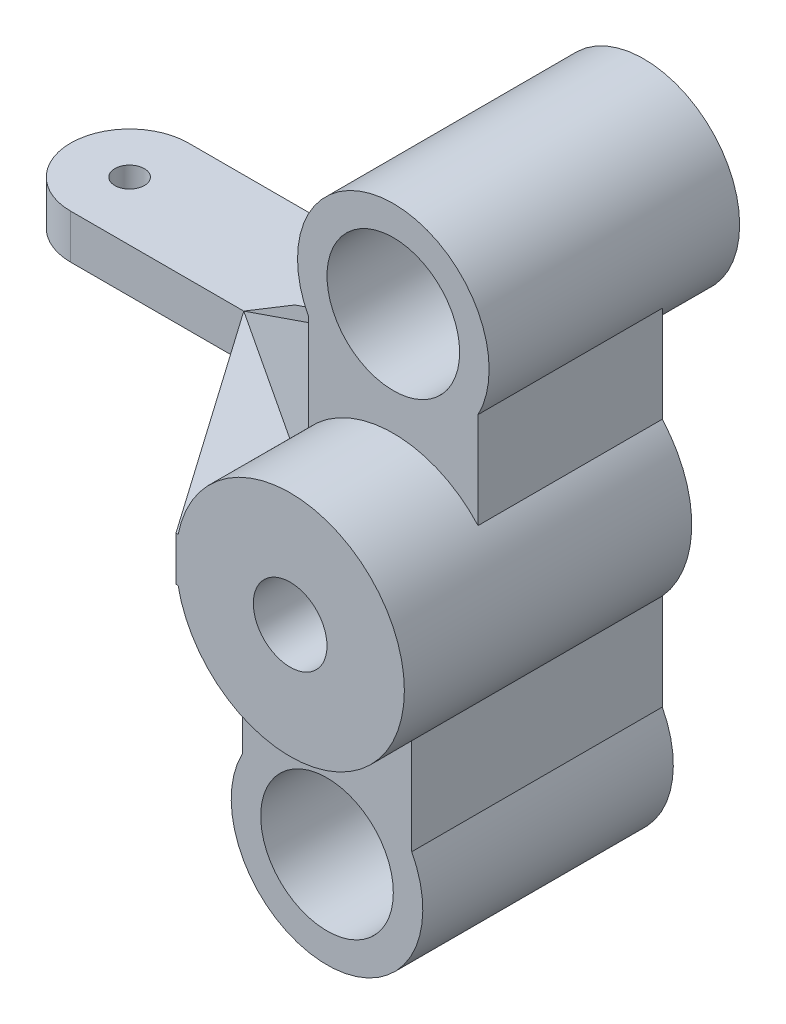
ISO-10303-21;
HEADER;
FILE_DESCRIPTION(('STEP AP214'),'2;1');
FILE_NAME('part.step','',(''),(''),'','','');
FILE_SCHEMA(('AUTOMOTIVE_DESIGN { 1 0 10303 214 1 1 1 1 }'));
ENDSEC;
DATA;
#1=APPLICATION_CONTEXT('core data for automotive mechanical design processes');
#2=APPLICATION_PROTOCOL_DEFINITION('international standard','automotive_design',2000,#1);
#3=PRODUCT_CONTEXT('',#1,'mechanical');
#4=PRODUCT('Part','Part','',(#3));
#5=PRODUCT_RELATED_PRODUCT_CATEGORY('part','',(#4));
#6=PRODUCT_DEFINITION_FORMATION('','',#4);
#7=PRODUCT_DEFINITION_CONTEXT('part definition',#1,'design');
#8=PRODUCT_DEFINITION('design','',#6,#7);
#9=PRODUCT_DEFINITION_SHAPE('','',#8);
#10=(LENGTH_UNIT() NAMED_UNIT(*) SI_UNIT(.MILLI.,.METRE.));
#11=(NAMED_UNIT(*) PLANE_ANGLE_UNIT() SI_UNIT($,.RADIAN.));
#12=(NAMED_UNIT(*) SI_UNIT($,.STERADIAN.) SOLID_ANGLE_UNIT());
#13=UNCERTAINTY_MEASURE_WITH_UNIT(LENGTH_MEASURE(1.E-05),#10,'distance_accuracy_value','');
#14=(GEOMETRIC_REPRESENTATION_CONTEXT(3) GLOBAL_UNCERTAINTY_ASSIGNED_CONTEXT((#13)) GLOBAL_UNIT_ASSIGNED_CONTEXT((#10,
#11,#12)) REPRESENTATION_CONTEXT('',''));
#15=CARTESIAN_POINT('',(0.,0.,0.));
#16=DIRECTION('',(0.,0.,1.));
#17=DIRECTION('',(1.,0.,0.));
#18=AXIS2_PLACEMENT_3D('',#15,#16,#17);
#19=CARTESIAN_POINT('',(0.,0.,7.));
#20=DIRECTION('',(0.,0.,-1.));
#21=DIRECTION('',(-1.,0.,0.));
#22=AXIS2_PLACEMENT_3D('',#19,#20,#21);
#23=CYLINDRICAL_SURFACE('',#22,7.75);
#24=CARTESIAN_POINT('',(0.,0.,0.77821657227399));
#25=DIRECTION('',(0.547993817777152,0.,-0.83648238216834));
#26=DIRECTION('',(-0.83648238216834,0.,-0.547993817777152));
#27=AXIS2_PLACEMENT_3D('',#24,#25,#26);
#28=ELLIPSE('',#27,9.26498891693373,7.75);
#29=CARTESIAN_POINT('',(-7.60345316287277,-1.5,-4.2029347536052));
#30=VERTEX_POINT('',#29);
#31=CARTESIAN_POINT('',(-5.75,-5.19615242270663,-2.98870610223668));
#32=VERTEX_POINT('',#31);
#33=EDGE_CURVE('E661',#30,#32,#28,.F.);
#34=ORIENTED_EDGE('',*,*,#33,.F.);
#35=DIRECTION('',(0.,0.,-1.));
#36=VECTOR('',#35,1.);
#37=CARTESIAN_POINT('',(-7.60345316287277,-1.5,7.));
#38=LINE('',#37,#36);
#39=CARTESIAN_POINT('',(-7.60345316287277,-1.5,-12.5));
#40=VERTEX_POINT('',#39);
#41=EDGE_CURVE('E733',#30,#40,#38,.T.);
#42=ORIENTED_EDGE('',*,*,#41,.T.);
#43=CARTESIAN_POINT('',(0.,0.,-12.5));
#44=DIRECTION('',(0.,0.,-1.));
#45=DIRECTION('',(-1.,0.,0.));
#46=AXIS2_PLACEMENT_3D('',#43,#44,#45);
#47=CIRCLE('',#46,7.75);
#48=CARTESIAN_POINT('',(-5.75,-5.19615242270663,-12.5));
#49=VERTEX_POINT('',#48);
#50=EDGE_CURVE('E835',#49,#40,#47,.T.);
#51=ORIENTED_EDGE('',*,*,#50,.F.);
#52=DIRECTION('',(0.,0.,-1.));
#53=VECTOR('',#52,1.);
#54=CARTESIAN_POINT('',(-5.75,-5.19615242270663,7.));
#55=LINE('',#54,#53);
#56=EDGE_CURVE('E846',#49,#32,#55,.F.);
#57=ORIENTED_EDGE('',*,*,#56,.T.);
#58=EDGE_LOOP('',(#34,#42,#51,#57));
#59=FACE_BOUND('',#58,.T.);
#60=ADVANCED_FACE('F353',(#59),#23,.T.);
#61=CARTESIAN_POINT('',(-30.25,-1.5,-12.3528691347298));
#62=DIRECTION('',(0.,1.,0.));
#63=DIRECTION('',(0.,0.,1.));
#64=AXIS2_PLACEMENT_3D('',#61,#62,#63);
#65=PLANE('',#64);
#66=DIRECTION('',(-0.83648238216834,0.,-0.547993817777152));
#67=VECTOR('',#66,1.);
#68=CARTESIAN_POINT('',(-28.5551147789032,-1.5,-14.940018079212));
#69=LINE('',#68,#67);
#70=CARTESIAN_POINT('',(-7.60345316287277,-1.5,-1.21422865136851));
#71=VERTEX_POINT('',#70);
#72=CARTESIAN_POINT('',(-18.5001947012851,-1.49999999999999,-8.35286913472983));
#73=VERTEX_POINT('',#72);
#74=EDGE_CURVE('E627',#71,#73,#69,.T.);
#75=ORIENTED_EDGE('',*,*,#74,.F.);
#76=CARTESIAN_POINT('',(-7.60345316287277,-1.5,6.99999999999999));
#77=VERTEX_POINT('',#76);
#78=EDGE_CURVE('E734',#77,#71,#38,.T.);
#79=ORIENTED_EDGE('',*,*,#78,.F.);
#80=DIRECTION('',(1.,0.,0.));
#81=VECTOR('',#80,1.);
#82=CARTESIAN_POINT('',(-7.75,-1.5,6.99999999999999));
#83=LINE('',#82,#81);
#84=CARTESIAN_POINT('',(-7.75,-1.5,6.99999999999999));
#85=VERTEX_POINT('',#84);
#86=EDGE_CURVE('E630',#85,#77,#83,.T.);
#87=ORIENTED_EDGE('',*,*,#86,.F.);
#88=DIRECTION('',(0.573576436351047,0.,0.819152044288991));
#89=VECTOR('',#88,1.);
#90=CARTESIAN_POINT('',(-7.75,-1.5,6.99999999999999));
#91=LINE('',#90,#89);
#92=EDGE_CURVE('E618',#73,#85,#91,.T.);
#93=ORIENTED_EDGE('',*,*,#92,.F.);
#94=EDGE_LOOP('',(#75,#79,#87,#93));
#95=FACE_BOUND('',#94,.T.);
#96=ADVANCED_FACE('F624',(#95),#65,.F.);
#97=CARTESIAN_POINT('',(0.,0.,0.));
#98=DIRECTION('',(0.,0.,1.));
#99=DIRECTION('',(1.,0.,0.));
#100=AXIS2_PLACEMENT_3D('',#97,#98,#99);
#101=CIRCLE('',#100,7.75);
#102=CARTESIAN_POINT('',(5.75,5.19615242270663,0.));
#103=VERTEX_POINT('',#102);
#104=CARTESIAN_POINT('',(-5.75,5.19615242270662,0.));
#105=VERTEX_POINT('',#104);
#106=EDGE_CURVE('E849',#103,#105,#101,.T.);
#107=ORIENTED_EDGE('',*,*,#106,.T.);
#108=CARTESIAN_POINT('',(0.,0.,3.76692267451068));
#109=DIRECTION('',(0.547993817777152,0.,-0.83648238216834));
#110=DIRECTION('',(-0.83648238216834,0.,-0.547993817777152));
#111=AXIS2_PLACEMENT_3D('',#108,#109,#110);
#112=ELLIPSE('',#111,9.26498891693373,7.75);
#113=CARTESIAN_POINT('',(-7.60345316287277,1.5,-1.21422865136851));
#114=VERTEX_POINT('',#113);
#115=EDGE_CURVE('E674',#105,#114,#112,.F.);
#116=ORIENTED_EDGE('',*,*,#115,.T.);
#117=DIRECTION('',(0.,0.,-1.));
#118=VECTOR('',#117,1.);
#119=CARTESIAN_POINT('',(-7.60345316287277,1.5,7.));
#120=LINE('',#119,#118);
#121=CARTESIAN_POINT('',(-7.60345316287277,1.5,6.99999999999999));
#122=VERTEX_POINT('',#121);
#123=EDGE_CURVE('E737',#122,#114,#120,.T.);
#124=ORIENTED_EDGE('',*,*,#123,.F.);
#125=CARTESIAN_POINT('',(0.,0.,7.));
#126=DIRECTION('',(0.,0.,-1.));
#127=DIRECTION('',(-1.,0.,0.));
#128=AXIS2_PLACEMENT_3D('',#125,#126,#127);
#129=CIRCLE('',#128,7.75);
#130=EDGE_CURVE('E840',#122,#77,#129,.T.);
#131=ORIENTED_EDGE('',*,*,#130,.T.);
#132=ORIENTED_EDGE('',*,*,#78,.T.);
#133=CARTESIAN_POINT('',(0.,0.,3.76692267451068));
#134=DIRECTION('',(0.547993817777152,0.,-0.83648238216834));
#135=DIRECTION('',(-0.83648238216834,0.,-0.547993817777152));
#136=AXIS2_PLACEMENT_3D('',#133,#134,#135);
#137=ELLIPSE('',#136,9.26498891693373,7.75);
#138=CARTESIAN_POINT('',(-5.75,-5.19615242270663,0.));
#139=VERTEX_POINT('',#138);
#140=EDGE_CURVE('E652',#71,#139,#137,.F.);
#141=ORIENTED_EDGE('',*,*,#140,.T.);
#142=CARTESIAN_POINT('',(-5.75,-5.19615242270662,4.5));
#143=VERTEX_POINT('',#142);
#144=EDGE_CURVE('E845',#139,#143,#55,.F.);
#145=ORIENTED_EDGE('',*,*,#144,.T.);
#146=CARTESIAN_POINT('',(0.,0.,4.5));
#147=DIRECTION('',(0.,0.,1.));
#148=DIRECTION('',(1.,0.,0.));
#149=AXIS2_PLACEMENT_3D('',#146,#147,#148);
#150=CIRCLE('',#149,7.75);
#151=CARTESIAN_POINT('',(5.75,-5.19615242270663,4.5));
#152=VERTEX_POINT('',#151);
#153=EDGE_CURVE('E895',#143,#152,#150,.T.);
#154=ORIENTED_EDGE('',*,*,#153,.T.);
#155=DIRECTION('',(0.,0.,-1.));
#156=VECTOR('',#155,1.);
#157=CARTESIAN_POINT('',(5.75,-5.19615242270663,7.));
#158=LINE('',#157,#156);
#159=CARTESIAN_POINT('',(5.75,-5.19615242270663,-12.5));
#160=VERTEX_POINT('',#159);
#161=EDGE_CURVE('E842',#152,#160,#158,.T.);
#162=ORIENTED_EDGE('',*,*,#161,.T.);
#163=CARTESIAN_POINT('',(5.75,5.19615242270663,-12.5));
#164=VERTEX_POINT('',#163);
#165=EDGE_CURVE('E838',#164,#160,#47,.T.);
#166=ORIENTED_EDGE('',*,*,#165,.F.);
#167=DIRECTION('',(0.,0.,-1.));
#168=VECTOR('',#167,1.);
#169=CARTESIAN_POINT('',(5.75,5.19615242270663,7.));
#170=LINE('',#169,#168);
#171=EDGE_CURVE('E851',#164,#103,#170,.F.);
#172=ORIENTED_EDGE('',*,*,#171,.T.);
#173=EDGE_LOOP('',(#107,#116,#124,#131,#132,#141,#145,#154,#162,#166,#172));
#174=FACE_BOUND('',#173,.T.);
#175=ADVANCED_FACE('F1009',(#174),#23,.T.);
#176=CARTESIAN_POINT('',(-30.25,1.5,-12.3528691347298));
#177=DIRECTION('',(0.,1.,0.));
#178=DIRECTION('',(0.,0.,1.));
#179=AXIS2_PLACEMENT_3D('',#176,#177,#178);
#180=PLANE('',#179);
#181=ORIENTED_EDGE('',*,*,#123,.T.);
#182=DIRECTION('',(-0.83648238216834,0.,-0.547993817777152));
#183=VECTOR('',#182,1.);
#184=CARTESIAN_POINT('',(-28.5551147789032,1.5,-14.940018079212));
#185=LINE('',#184,#183);
#186=CARTESIAN_POINT('',(-18.500194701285,1.5,-8.35286913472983));
#187=VERTEX_POINT('',#186);
#188=EDGE_CURVE('E677',#114,#187,#185,.T.);
#189=ORIENTED_EDGE('',*,*,#188,.T.);
#190=DIRECTION('',(0.573576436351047,0.,0.819152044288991));
#191=VECTOR('',#190,1.);
#192=CARTESIAN_POINT('',(-7.75,1.5,6.99999999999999));
#193=LINE('',#192,#191);
#194=CARTESIAN_POINT('',(-7.75,1.5,6.99999999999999));
#195=VERTEX_POINT('',#194);
#196=EDGE_CURVE('E635',#187,#195,#193,.T.);
#197=ORIENTED_EDGE('',*,*,#196,.T.);
#198=DIRECTION('',(1.,0.,0.));
#199=VECTOR('',#198,1.);
#200=CARTESIAN_POINT('',(-7.75,1.5,6.99999999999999));
#201=LINE('',#200,#199);
#202=EDGE_CURVE('E714',#195,#122,#201,.T.);
#203=ORIENTED_EDGE('',*,*,#202,.T.);
#204=EDGE_LOOP('',(#181,#189,#197,#203));
#205=FACE_BOUND('',#204,.T.);
#206=ADVANCED_FACE('F1033',(#205),#180,.T.);
#207=CARTESIAN_POINT('',(-5.75,-14.75,-12.5));
#208=DIRECTION('',(0.,0.,1.));
#209=DIRECTION('',(1.,0.,0.));
#210=AXIS2_PLACEMENT_3D('',#207,#208,#209);
#211=PLANE('',#210);
#212=CARTESIAN_POINT('',(0.,0.,-12.5));
#213=DIRECTION('',(0.,0.,-1.));
#214=DIRECTION('',(-1.,0.,0.));
#215=AXIS2_PLACEMENT_3D('',#212,#213,#214);
#216=CIRCLE('',#215,7.25);
#217=CARTESIAN_POINT('',(-7.23519163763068,0.463143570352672,-12.5));
#218=VERTEX_POINT('',#217);
#219=CARTESIAN_POINT('',(-7.23519163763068,-0.463143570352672,-12.5));
#220=VERTEX_POINT('',#219);
#221=EDGE_CURVE('E740',#218,#220,#216,.T.);
#222=ORIENTED_EDGE('',*,*,#221,.F.);
#223=DIRECTION('',(0.,-1.,0.));
#224=VECTOR('',#223,1.);
#225=CARTESIAN_POINT('',(-7.23519163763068,1.5,-12.5));
#226=LINE('',#225,#224);
#227=EDGE_CURVE('E728',#218,#220,#226,.T.);
#228=ORIENTED_EDGE('',*,*,#227,.T.);
#229=EDGE_LOOP('',(#222,#228));
#230=FACE_BOUND('',#229,.T.);
#231=DIRECTION('',(-1.,0.,0.));
#232=VECTOR('',#231,1.);
#233=CARTESIAN_POINT('',(-7.23519163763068,1.5,-12.5));
#234=LINE('',#233,#232);
#235=CARTESIAN_POINT('',(-7.60345316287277,1.5,-12.5));
#236=VERTEX_POINT('',#235);
#237=CARTESIAN_POINT('',(-7.73519163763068,1.5,-12.5));
#238=VERTEX_POINT('',#237);
#239=EDGE_CURVE('E716',#236,#238,#234,.T.);
#240=ORIENTED_EDGE('',*,*,#239,.F.);
#241=CARTESIAN_POINT('',(-5.75,5.19615242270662,-12.5));
#242=VERTEX_POINT('',#241);
#243=EDGE_CURVE('E839',#236,#242,#47,.T.);
#244=ORIENTED_EDGE('',*,*,#243,.T.);
#245=DIRECTION('',(0.,-1.,0.));
#246=VECTOR('',#245,1.);
#247=CARTESIAN_POINT('',(-5.75,14.75,-12.5));
#248=LINE('',#247,#246);
#249=CARTESIAN_POINT('',(-5.75,11.7189110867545,-12.5));
#250=VERTEX_POINT('',#249);
#251=EDGE_CURVE('E1105',#250,#242,#248,.T.);
#252=ORIENTED_EDGE('',*,*,#251,.F.);
#253=CARTESIAN_POINT('',(0.,14.75,-12.5));
#254=DIRECTION('',(0.,0.,1.));
#255=DIRECTION('',(1.,0.,0.));
#256=AXIS2_PLACEMENT_3D('',#253,#254,#255);
#257=CIRCLE('',#256,6.5);
#258=CARTESIAN_POINT('',(5.75,11.7189110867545,-12.5));
#259=VERTEX_POINT('',#258);
#260=EDGE_CURVE('E861',#250,#259,#257,.T.);
#261=ORIENTED_EDGE('',*,*,#260,.T.);
#262=DIRECTION('',(0.,1.,0.));
#263=VECTOR('',#262,1.);
#264=CARTESIAN_POINT('',(5.75,14.75,-12.5));
#265=LINE('',#264,#263);
#266=EDGE_CURVE('E1100',#164,#259,#265,.T.);
#267=ORIENTED_EDGE('',*,*,#266,.F.);
#268=ORIENTED_EDGE('',*,*,#165,.T.);
#269=CARTESIAN_POINT('',(5.75,-11.7189110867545,-12.5));
#270=VERTEX_POINT('',#269);
#271=EDGE_CURVE('E894',#270,#160,#265,.T.);
#272=ORIENTED_EDGE('',*,*,#271,.F.);
#273=CARTESIAN_POINT('',(0.,-14.75,-12.5));
#274=DIRECTION('',(0.,0.,1.));
#275=DIRECTION('',(1.,0.,0.));
#276=AXIS2_PLACEMENT_3D('',#273,#274,#275);
#277=CIRCLE('',#276,6.5);
#278=CARTESIAN_POINT('',(-5.75,-11.7189110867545,-12.5));
#279=VERTEX_POINT('',#278);
#280=EDGE_CURVE('E872',#279,#270,#277,.T.);
#281=ORIENTED_EDGE('',*,*,#280,.F.);
#282=EDGE_CURVE('E899',#49,#279,#248,.T.);
#283=ORIENTED_EDGE('',*,*,#282,.F.);
#284=ORIENTED_EDGE('',*,*,#50,.T.);
#285=DIRECTION('',(-1.,0.,0.));
#286=VECTOR('',#285,1.);
#287=CARTESIAN_POINT('',(-7.23519163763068,-1.5,-12.5));
#288=LINE('',#287,#286);
#289=CARTESIAN_POINT('',(-7.73519163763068,-1.5,-12.5));
#290=VERTEX_POINT('',#289);
#291=EDGE_CURVE('E698',#40,#290,#288,.T.);
#292=ORIENTED_EDGE('',*,*,#291,.T.);
#293=DIRECTION('',(0.,-1.,0.));
#294=VECTOR('',#293,1.);
#295=CARTESIAN_POINT('',(-7.73519163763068,1.5,-12.5));
#296=LINE('',#295,#294);
#297=EDGE_CURVE('E726',#238,#290,#296,.T.);
#298=ORIENTED_EDGE('',*,*,#297,.F.);
#299=EDGE_LOOP('',(#240,#244,#252,#261,#267,#268,#272,#281,#283,#284,#292,#298));
#300=FACE_BOUND('',#299,.T.);
#301=DIRECTION('',(-1.,0.,0.));
#302=VECTOR('',#301,1.);
#303=CARTESIAN_POINT('',(4.5,-18.25,-12.5000000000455));
#304=LINE('',#303,#302);
#305=CARTESIAN_POINT('',(4.5,-18.2499999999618,-12.5));
#306=VERTEX_POINT('',#305);
#307=CARTESIAN_POINT('',(-4.5,-18.25,-12.5000000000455));
#308=VERTEX_POINT('',#307);
#309=EDGE_CURVE('E749',#306,#308,#304,.T.);
#310=ORIENTED_EDGE('',*,*,#309,.F.);
#311=DIRECTION('',(0.,-1.,0.));
#312=VECTOR('',#311,1.);
#313=CARTESIAN_POINT('',(4.5,-11.25,-12.5000000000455));
#314=LINE('',#313,#312);
#315=CARTESIAN_POINT('',(4.5,-11.25,-12.5000000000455));
#316=VERTEX_POINT('',#315);
#317=EDGE_CURVE('E746',#316,#306,#314,.T.);
#318=ORIENTED_EDGE('',*,*,#317,.F.);
#319=DIRECTION('',(1.,0.,0.));
#320=VECTOR('',#319,1.);
#321=CARTESIAN_POINT('',(4.5,-11.25,-12.5000000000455));
#322=LINE('',#321,#320);
#323=CARTESIAN_POINT('',(-4.5,-11.25,-12.5000000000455));
#324=VERTEX_POINT('',#323);
#325=EDGE_CURVE('E755',#324,#316,#322,.T.);
#326=ORIENTED_EDGE('',*,*,#325,.F.);
#327=DIRECTION('',(0.,1.,0.));
#328=VECTOR('',#327,1.);
#329=CARTESIAN_POINT('',(-4.5,-11.25,-12.5000000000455));
#330=LINE('',#329,#328);
#331=EDGE_CURVE('E752',#308,#324,#330,.T.);
#332=ORIENTED_EDGE('',*,*,#331,.F.);
#333=EDGE_LOOP('',(#310,#318,#326,#332));
#334=FACE_BOUND('',#333,.T.);
#335=ADVANCED_FACE('F1030',(#230,#300,#334),#211,.F.);
#336=CARTESIAN_POINT('',(0.,0.,-12.5));
#337=DIRECTION('',(0.,0.,-1.));
#338=DIRECTION('',(-1.,0.,0.));
#339=AXIS2_PLACEMENT_3D('',#336,#337,#338);
#340=CONICAL_SURFACE('',#339,7.25,0.218166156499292);
#341=CARTESIAN_POINT('',(0.,0.,-2.5));
#342=DIRECTION('',(0.,0.,-1.));
#343=DIRECTION('',(-1.,0.,0.));
#344=AXIS2_PLACEMENT_3D('',#341,#342,#343);
#345=CIRCLE('',#344,5.0330533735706);
#346=CARTESIAN_POINT('',(-5.03305337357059,0.,-2.5));
#347=VERTEX_POINT('',#346);
#348=EDGE_CURVE('E742',#347,#347,#345,.T.);
#349=ORIENTED_EDGE('',*,*,#348,.F.);
#350=EDGE_LOOP('',(#349));
#351=FACE_BOUND('',#350,.T.);
#352=CARTESIAN_POINT('',(-7.23519163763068,6.16577720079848,-22.6763411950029));
#353=CARTESIAN_POINT('',(-7.23519163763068,6.05568096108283,-22.354311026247));
#354=CARTESIAN_POINT('',(-7.23519163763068,5.94410119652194,-22.0327807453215));
#355=CARTESIAN_POINT('',(-7.23519163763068,5.71735114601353,-21.3909438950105));
#356=CARTESIAN_POINT('',(-7.23519163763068,5.60218040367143,-21.0706374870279));
#357=CARTESIAN_POINT('',(-7.23519163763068,5.36734110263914,-20.4307055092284));
#358=CARTESIAN_POINT('',(-7.23519163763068,5.24766140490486,-20.1110840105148));
#359=CARTESIAN_POINT('',(-7.23519163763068,5.00324840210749,-19.473798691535));
#360=CARTESIAN_POINT('',(-7.23519163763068,4.87851535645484,-19.1561347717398));
#361=CARTESIAN_POINT('',(-7.23519163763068,4.57847466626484,-18.4132300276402));
#362=CARTESIAN_POINT('',(-7.23519163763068,4.40066140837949,-17.9889873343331));
#363=CARTESIAN_POINT('',(-7.23519163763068,4.12270297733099,-17.3578728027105));
#364=CARTESIAN_POINT('',(-7.23519163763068,4.02823736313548,-17.1485007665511));
#365=CARTESIAN_POINT('',(-7.23519163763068,3.83478293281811,-16.7318680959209));
#366=CARTESIAN_POINT('',(-7.23519163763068,3.73579432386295,-16.5246073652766));
#367=CARTESIAN_POINT('',(-7.23519163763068,3.49527939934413,-16.0376110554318));
#368=CARTESIAN_POINT('',(-7.23519163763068,3.35140715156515,-15.759014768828));
#369=CARTESIAN_POINT('',(-7.23519163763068,3.12525629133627,-15.3463550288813));
#370=CARTESIAN_POINT('',(-7.23519163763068,3.04804859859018,-15.2095108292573));
#371=CARTESIAN_POINT('',(-7.23519163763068,2.88959949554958,-14.9381846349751));
#372=CARTESIAN_POINT('',(-7.23519163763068,2.80835849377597,-14.8037024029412));
#373=CARTESIAN_POINT('',(-7.23519163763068,2.63769266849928,-14.5323917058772));
#374=CARTESIAN_POINT('',(-7.23519163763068,2.54807000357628,-14.3956869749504));
#375=CARTESIAN_POINT('',(-7.23519163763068,2.36248691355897,-14.1266746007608));
#376=CARTESIAN_POINT('',(-7.23519163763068,2.26652850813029,-13.9943655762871));
#377=CARTESIAN_POINT('',(-7.23519163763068,2.06700218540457,-13.7361741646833));
#378=CARTESIAN_POINT('',(-7.23519163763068,1.96345729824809,-13.6102741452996));
#379=CARTESIAN_POINT('',(-7.23519163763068,1.74657648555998,-13.3673032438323));
#380=CARTESIAN_POINT('',(-7.23519163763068,1.63325315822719,-13.2502213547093));
#381=CARTESIAN_POINT('',(-7.23519163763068,1.41783989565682,-13.0512528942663));
#382=CARTESIAN_POINT('',(-7.23519163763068,1.31797235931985,-12.9669890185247));
#383=CARTESIAN_POINT('',(-7.23519163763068,1.10873981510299,-12.810903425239));
#384=CARTESIAN_POINT('',(-7.23519163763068,0.999379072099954,-12.7390761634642));
#385=CARTESIAN_POINT('',(-7.23519163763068,0.79120411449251,-12.6250833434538));
#386=CARTESIAN_POINT('',(-7.23519163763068,0.694069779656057,-12.5799013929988));
#387=CARTESIAN_POINT('',(-7.23519163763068,0.493779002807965,-12.5060529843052));
#388=CARTESIAN_POINT('',(-7.23519163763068,0.390642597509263,-12.4773346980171));
#389=CARTESIAN_POINT('',(-7.23519163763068,0.238656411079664,-12.450256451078));
#390=CARTESIAN_POINT('',(-7.23519163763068,0.191164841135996,-12.4438870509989));
#391=CARTESIAN_POINT('',(-7.23519163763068,0.095793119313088,-12.4353535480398));
#392=CARTESIAN_POINT('',(-7.23519163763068,0.047912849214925,-12.4331907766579));
#393=CARTESIAN_POINT('',(-7.23519163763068,-0.112153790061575,-12.4332342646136));
#394=CARTESIAN_POINT('',(-7.23519163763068,-0.224486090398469,-12.4451865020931));
#395=CARTESIAN_POINT('',(-7.23519163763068,-0.444625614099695,-12.4909638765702));
#396=CARTESIAN_POINT('',(-7.23519163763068,-0.552418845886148,-12.5248520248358));
#397=CARTESIAN_POINT('',(-7.23519163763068,-0.789482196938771,-12.6214831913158));
#398=CARTESIAN_POINT('',(-7.23519163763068,-0.916508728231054,-12.6895979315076));
#399=CARTESIAN_POINT('',(-7.23519163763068,-1.15851566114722,-12.8444852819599));
#400=CARTESIAN_POINT('',(-7.23519163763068,-1.27346345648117,-12.9313065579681));
#401=CARTESIAN_POINT('',(-7.23519163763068,-1.51781142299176,-13.1382567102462));
#402=CARTESIAN_POINT('',(-7.23519163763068,-1.64455114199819,-13.2614696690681));
#403=CARTESIAN_POINT('',(-7.23519163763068,-1.88583588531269,-13.5194425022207));
#404=CARTESIAN_POINT('',(-7.23519163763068,-2.00035717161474,-13.6542239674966));
#405=CARTESIAN_POINT('',(-7.23519163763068,-2.22112827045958,-13.9330456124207));
#406=CARTESIAN_POINT('',(-7.23519163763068,-2.32725784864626,-14.0771799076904));
#407=CARTESIAN_POINT('',(-7.23519163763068,-2.53164127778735,-14.3706557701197));
#408=CARTESIAN_POINT('',(-7.23519163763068,-2.62990289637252,-14.5199919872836));
#409=CARTESIAN_POINT('',(-7.23519163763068,-2.82734754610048,-14.8339070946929));
#410=CARTESIAN_POINT('',(-7.23519163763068,-2.92604620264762,-14.9987887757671));
#411=CARTESIAN_POINT('',(-7.23519163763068,-3.11765818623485,-15.3318951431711));
#412=CARTESIAN_POINT('',(-7.23519163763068,-3.2105705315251,-15.5001203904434));
#413=CARTESIAN_POINT('',(-7.23519163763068,-3.39168139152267,-15.8392255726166));
#414=CARTESIAN_POINT('',(-7.23519163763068,-3.47987667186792,-16.0101072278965));
#415=CARTESIAN_POINT('',(-7.23519163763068,-3.65226298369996,-16.3538833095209));
#416=CARTESIAN_POINT('',(-7.23519163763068,-3.73645376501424,-16.5267778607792));
#417=CARTESIAN_POINT('',(-7.23519163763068,-3.9845819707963,-17.049190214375));
#418=CARTESIAN_POINT('',(-7.23519163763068,-4.14339688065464,-17.40114128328));
#419=CARTESIAN_POINT('',(-7.23519163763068,-4.4508074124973,-18.1092704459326));
#420=CARTESIAN_POINT('',(-7.23519163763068,-4.59940685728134,-18.4654468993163));
#421=CARTESIAN_POINT('',(-7.23519163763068,-4.87287128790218,-19.1418321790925));
#422=CARTESIAN_POINT('',(-7.23519163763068,-4.99855405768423,-19.461711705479));
#423=CARTESIAN_POINT('',(-7.23519163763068,-5.24479879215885,-20.1034714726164));
#424=CARTESIAN_POINT('',(-7.23519163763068,-5.36536017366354,-20.4253519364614));
#425=CARTESIAN_POINT('',(-7.23519163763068,-5.60125557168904,-21.0680736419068));
#426=CARTESIAN_POINT('',(-7.23519163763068,-5.7166239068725,-21.3889023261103));
#427=CARTESIAN_POINT('',(-7.23519163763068,-5.94374922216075,-22.0317677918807));
#428=CARTESIAN_POINT('',(-7.23519163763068,-6.05550688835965,-22.3538043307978));
#429=CARTESIAN_POINT('',(-7.23519163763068,-6.16577720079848,-22.6763411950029));
#430=B_SPLINE_CURVE_WITH_KNOTS('',3,(#352,#353,#354,#355,#356,#357,#358,#359,#360,#361,#362,
#363,#364,#365,#366,#367,#368,#369,#370,#371,#372,#373,#374,#375,#376,#377,#378,#379,#380,#381,
#382,#383,#384,#385,#386,#387,#388,#389,#390,#391,#392,#393,#394,#395,#396,#397,#398,#399,#400,
#401,#402,#403,#404,#405,#406,#407,#408,#409,#410,#411,#412,#413,#414,#415,#416,#417,#418,#419,
#420,#421,#422,#423,#424,#425,#426,#427,#428,#429),.UNSPECIFIED.,.F.,.F.,(4,2,2,2,2,2,2,2,2,2,2,
2,2,2,2,2,2,2,2,2,2,2,2,2,2,2,2,2,2,2,2,2,2,2,2,2,2,2,4),(0.,1.02099674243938,2.0421237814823,
3.0659643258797,4.08975237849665,5.46949842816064,6.15854173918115,6.84755352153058,
7.78788230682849,8.25919572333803,8.73046149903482,9.2207124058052,9.7108077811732,
10.1994725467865,10.6875168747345,11.0788721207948,11.4700524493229,11.790347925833,
12.1096294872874,12.2532139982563,12.3968439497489,12.7330511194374,13.0702283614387,
13.500110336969,13.9311244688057,14.4601840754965,14.9902535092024,15.5268986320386,
16.0630072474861,16.639353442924,17.2157971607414,17.7926311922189,18.3695012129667,
19.5276247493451,20.685312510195,21.7163130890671,22.7474307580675,23.7702319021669,
24.7928375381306),.UNSPECIFIED.);
#431=EDGE_CURVE('E362',#218,#220,#430,.T.);
#432=ORIENTED_EDGE('',*,*,#431,.F.);
#433=ORIENTED_EDGE('',*,*,#221,.T.);
#434=EDGE_LOOP('',(#432,#433));
#435=FACE_BOUND('',#434,.T.);
#436=ADVANCED_FACE('F355',(#351,#435),#340,.F.);
#437=CARTESIAN_POINT('',(0.,0.,-17.));
#438=DIRECTION('',(0.,0.,1.));
#439=DIRECTION('',(1.,0.,0.));
#440=AXIS2_PLACEMENT_3D('',#437,#438,#439);
#441=CYLINDRICAL_SURFACE('',#440,2.5);
#442=CARTESIAN_POINT('',(0.,0.,-2.5));
#443=DIRECTION('',(0.,0.,-1.));
#444=DIRECTION('',(-1.,0.,0.));
#445=AXIS2_PLACEMENT_3D('',#442,#443,#444);
#446=CIRCLE('',#445,2.5);
#447=CARTESIAN_POINT('',(-2.5,0.,-2.5));
#448=VERTEX_POINT('',#447);
#449=EDGE_CURVE('E747',#448,#448,#446,.F.);
#450=ORIENTED_EDGE('',*,*,#449,.F.);
#451=EDGE_LOOP('',(#450));
#452=FACE_BOUND('',#451,.T.);
#453=CARTESIAN_POINT('',(0.,0.,7.));
#454=DIRECTION('',(0.,0.,1.));
#455=DIRECTION('',(1.,0.,0.));
#456=AXIS2_PLACEMENT_3D('',#453,#454,#455);
#457=CIRCLE('',#456,2.5);
#458=CARTESIAN_POINT('',(2.5,0.,7.));
#459=VERTEX_POINT('',#458);
#460=EDGE_CURVE('E743',#459,#459,#457,.T.);
#461=ORIENTED_EDGE('',*,*,#460,.T.);
#462=EDGE_LOOP('',(#461));
#463=FACE_BOUND('',#462,.T.);
#464=ADVANCED_FACE('F945',(#452,#463),#441,.F.);
#465=CARTESIAN_POINT('',(0.,-14.75,-12.0000000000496));
#466=DIRECTION('',(0.,0.,1.));
#467=DIRECTION('',(1.,0.,0.));
#468=AXIS2_PLACEMENT_3D('',#465,#466,#467);
#469=PLANE('',#468);
#470=DIRECTION('',(0.,1.,0.));
#471=VECTOR('',#470,1.);
#472=CARTESIAN_POINT('',(4.0804501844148,-14.75,-12.0000000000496));
#473=LINE('',#472,#471);
#474=CARTESIAN_POINT('',(4.0804501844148,-16.6473471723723,-12.0000000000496));
#475=VERTEX_POINT('',#474);
#476=CARTESIAN_POINT('',(4.0804501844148,-12.8526528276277,-12.0000000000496));
#477=VERTEX_POINT('',#476);
#478=EDGE_CURVE('E913',#475,#477,#473,.T.);
#479=ORIENTED_EDGE('',*,*,#478,.F.);
#480=CARTESIAN_POINT('',(0.,-14.75,-12.0000000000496));
#481=DIRECTION('',(0.,0.,1.));
#482=DIRECTION('',(1.,0.,0.));
#483=AXIS2_PLACEMENT_3D('',#480,#481,#482);
#484=CIRCLE('',#483,4.5);
#485=EDGE_CURVE('E786',#475,#477,#484,.T.);
#486=ORIENTED_EDGE('',*,*,#485,.T.);
#487=EDGE_LOOP('',(#479,#486));
#488=FACE_BOUND('',#487,.T.);
#489=ADVANCED_FACE('F948',(#488),#469,.T.);
#490=DIRECTION('',(-1.,0.,0.));
#491=VECTOR('',#490,1.);
#492=CARTESIAN_POINT('',(0.,-11.6695498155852,-12.0000000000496));
#493=LINE('',#492,#491);
#494=CARTESIAN_POINT('',(3.28036989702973,-11.6695498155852,-12.0000000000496));
#495=VERTEX_POINT('',#494);
#496=CARTESIAN_POINT('',(-3.28036989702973,-11.6695498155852,-12.0000000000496));
#497=VERTEX_POINT('',#496);
#498=EDGE_CURVE('E911',#495,#497,#493,.T.);
#499=ORIENTED_EDGE('',*,*,#498,.F.);
#500=EDGE_CURVE('E790',#495,#497,#484,.T.);
#501=ORIENTED_EDGE('',*,*,#500,.T.);
#502=EDGE_LOOP('',(#499,#501));
#503=FACE_BOUND('',#502,.T.);
#504=ADVANCED_FACE('F1311',(#503),#469,.T.);
#505=DIRECTION('',(0.,-1.,0.));
#506=VECTOR('',#505,1.);
#507=CARTESIAN_POINT('',(-4.08045018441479,-14.75,-12.0000000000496));
#508=LINE('',#507,#506);
#509=CARTESIAN_POINT('',(-4.08045018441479,-12.8526528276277,-12.0000000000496));
#510=VERTEX_POINT('',#509);
#511=CARTESIAN_POINT('',(-4.08045018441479,-16.6473471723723,-12.0000000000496));
#512=VERTEX_POINT('',#511);
#513=EDGE_CURVE('E909',#510,#512,#508,.T.);
#514=ORIENTED_EDGE('',*,*,#513,.F.);
#515=EDGE_CURVE('E1418',#510,#512,#484,.T.);
#516=ORIENTED_EDGE('',*,*,#515,.T.);
#517=EDGE_LOOP('',(#514,#516));
#518=FACE_BOUND('',#517,.T.);
#519=ADVANCED_FACE('F970',(#518),#469,.T.);
#520=CARTESIAN_POINT('',(0.,14.75,-16.5));
#521=DIRECTION('',(0.,0.,1.));
#522=DIRECTION('',(1.,0.,0.));
#523=AXIS2_PLACEMENT_3D('',#520,#521,#522);
#524=PLANE('',#523);
#525=DIRECTION('',(0.,1.,0.));
#526=VECTOR('',#525,1.);
#527=CARTESIAN_POINT('',(4.08045018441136,14.75,-16.5));
#528=LINE('',#527,#526);
#529=CARTESIAN_POINT('',(4.08045018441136,12.8526528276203,-16.5));
#530=VERTEX_POINT('',#529);
#531=CARTESIAN_POINT('',(4.08045018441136,16.6473471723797,-16.5));
#532=VERTEX_POINT('',#531);
#533=EDGE_CURVE('E905',#530,#532,#528,.T.);
#534=ORIENTED_EDGE('',*,*,#533,.F.);
#535=CARTESIAN_POINT('',(0.,14.75,-16.5));
#536=DIRECTION('',(0.,0.,1.));
#537=DIRECTION('',(1.,0.,0.));
#538=AXIS2_PLACEMENT_3D('',#535,#536,#537);
#539=CIRCLE('',#538,4.5);
#540=EDGE_CURVE('E830',#530,#532,#539,.T.);
#541=ORIENTED_EDGE('',*,*,#540,.T.);
#542=EDGE_LOOP('',(#534,#541));
#543=FACE_BOUND('',#542,.T.);
#544=ADVANCED_FACE('F995',(#543),#524,.T.);
#545=DIRECTION('',(-1.,0.,0.));
#546=VECTOR('',#545,1.);
#547=CARTESIAN_POINT('',(0.,17.8304501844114,-16.5));
#548=LINE('',#547,#546);
#549=CARTESIAN_POINT('',(3.28036989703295,17.8304501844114,-16.5));
#550=VERTEX_POINT('',#549);
#551=CARTESIAN_POINT('',(-3.28036989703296,17.8304501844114,-16.5));
#552=VERTEX_POINT('',#551);
#553=EDGE_CURVE('E903',#550,#552,#548,.T.);
#554=ORIENTED_EDGE('',*,*,#553,.F.);
#555=EDGE_CURVE('E834',#550,#552,#539,.T.);
#556=ORIENTED_EDGE('',*,*,#555,.T.);
#557=EDGE_LOOP('',(#554,#556));
#558=FACE_BOUND('',#557,.T.);
#559=ADVANCED_FACE('F1292',(#558),#524,.T.);
#560=DIRECTION('',(0.,-1.,0.));
#561=VECTOR('',#560,1.);
#562=CARTESIAN_POINT('',(-4.08045018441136,14.75,-16.5));
#563=LINE('',#562,#561);
#564=CARTESIAN_POINT('',(-4.08045018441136,16.6473471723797,-16.5));
#565=VERTEX_POINT('',#564);
#566=CARTESIAN_POINT('',(-4.08045018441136,12.8526528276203,-16.5));
#567=VERTEX_POINT('',#566);
#568=EDGE_CURVE('E901',#565,#567,#563,.T.);
#569=ORIENTED_EDGE('',*,*,#568,.F.);
#570=EDGE_CURVE('E1094',#565,#567,#539,.T.);
#571=ORIENTED_EDGE('',*,*,#570,.T.);
#572=EDGE_LOOP('',(#569,#571));
#573=FACE_BOUND('',#572,.T.);
#574=ADVANCED_FACE('F996',(#573),#524,.T.);
#575=CARTESIAN_POINT('',(-5.75,14.75,-12.5));
#576=DIRECTION('',(-1.,0.,0.));
#577=DIRECTION('',(0.,-1.,0.));
#578=AXIS2_PLACEMENT_3D('',#575,#576,#577);
#579=PLANE('',#578);
#580=DIRECTION('',(0.,-1.,0.));
#581=VECTOR('',#580,1.);
#582=CARTESIAN_POINT('',(-5.75,14.75,-2.98870610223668));
#583=LINE('',#582,#581);
#584=CARTESIAN_POINT('',(-5.75,10.3115527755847,-2.98870610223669));
#585=VERTEX_POINT('',#584);
#586=CARTESIAN_POINT('',(-5.75,5.19615242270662,-2.98870610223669));
#587=VERTEX_POINT('',#586);
#588=EDGE_CURVE('E684',#585,#587,#583,.T.);
#589=ORIENTED_EDGE('',*,*,#588,.F.);
#590=DIRECTION('',(0.,0.334480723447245,0.942402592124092));
#591=VECTOR('',#590,1.);
#592=CARTESIAN_POINT('',(-5.75,7.81000723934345,-10.0368342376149));
#593=LINE('',#592,#591);
#594=CARTESIAN_POINT('',(-5.75,11.3723144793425,0.));
#595=VERTEX_POINT('',#594);
#596=EDGE_CURVE('E690',#595,#585,#593,.F.);
#597=ORIENTED_EDGE('',*,*,#596,.F.);
#598=DIRECTION('',(0.,-1.,0.));
#599=VECTOR('',#598,1.);
#600=CARTESIAN_POINT('',(-5.75,14.75,0.));
#601=LINE('',#600,#599);
#602=CARTESIAN_POINT('',(-5.75,11.7189110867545,0.));
#603=VERTEX_POINT('',#602);
#604=EDGE_CURVE('E884',#603,#595,#601,.T.);
#605=ORIENTED_EDGE('',*,*,#604,.F.);
#606=DIRECTION('',(0.,0.,1.));
#607=VECTOR('',#606,1.);
#608=CARTESIAN_POINT('',(-5.75,11.7189110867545,-17.));
#609=LINE('',#608,#607);
#610=EDGE_CURVE('E867',#250,#603,#609,.T.);
#611=ORIENTED_EDGE('',*,*,#610,.F.);
#612=ORIENTED_EDGE('',*,*,#251,.T.);
#613=DIRECTION('',(0.,0.,-1.));
#614=VECTOR('',#613,1.);
#615=CARTESIAN_POINT('',(-5.75,5.19615242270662,7.));
#616=LINE('',#615,#614);
#617=EDGE_CURVE('E854',#587,#242,#616,.T.);
#618=ORIENTED_EDGE('',*,*,#617,.F.);
#619=EDGE_LOOP('',(#589,#597,#605,#611,#612,#618));
#620=FACE_BOUND('',#619,.T.);
#621=ADVANCED_FACE('F1040',(#620),#579,.T.);
#622=CARTESIAN_POINT('',(5.75,14.75,-12.5));
#623=DIRECTION('',(1.,0.,0.));
#624=DIRECTION('',(0.,1.,0.));
#625=AXIS2_PLACEMENT_3D('',#622,#623,#624);
#626=PLANE('',#625);
#627=ORIENTED_EDGE('',*,*,#161,.F.);
#628=DIRECTION('',(0.,1.,0.));
#629=VECTOR('',#628,1.);
#630=CARTESIAN_POINT('',(5.75,0.,4.5));
#631=LINE('',#630,#629);
#632=CARTESIAN_POINT('',(5.75,-11.7189110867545,4.5));
#633=VERTEX_POINT('',#632);
#634=EDGE_CURVE('E881',#633,#152,#631,.T.);
#635=ORIENTED_EDGE('',*,*,#634,.F.);
#636=DIRECTION('',(0.,0.,1.));
#637=VECTOR('',#636,1.);
#638=CARTESIAN_POINT('',(5.75,-11.7189110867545,-12.5));
#639=LINE('',#638,#637);
#640=EDGE_CURVE('E874',#270,#633,#639,.T.);
#641=ORIENTED_EDGE('',*,*,#640,.F.);
#642=ORIENTED_EDGE('',*,*,#271,.T.);
#643=EDGE_LOOP('',(#627,#635,#641,#642));
#644=FACE_BOUND('',#643,.T.);
#645=ADVANCED_FACE('F1038',(#644),#626,.T.);
#646=DIRECTION('',(0.,-1.,0.));
#647=VECTOR('',#646,1.);
#648=CARTESIAN_POINT('',(-5.75,14.75,-2.98870610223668));
#649=LINE('',#648,#647);
#650=CARTESIAN_POINT('',(-5.75,-10.3115527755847,-2.98870610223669));
#651=VERTEX_POINT('',#650);
#652=EDGE_CURVE('E653',#32,#651,#649,.T.);
#653=ORIENTED_EDGE('',*,*,#652,.F.);
#654=ORIENTED_EDGE('',*,*,#56,.F.);
#655=ORIENTED_EDGE('',*,*,#282,.T.);
#656=DIRECTION('',(0.,0.,1.));
#657=VECTOR('',#656,1.);
#658=CARTESIAN_POINT('',(-5.75,-11.7189110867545,-12.5));
#659=LINE('',#658,#657);
#660=CARTESIAN_POINT('',(-5.75,-11.7189110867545,4.5));
#661=VERTEX_POINT('',#660);
#662=EDGE_CURVE('E877',#661,#279,#659,.F.);
#663=ORIENTED_EDGE('',*,*,#662,.F.);
#664=DIRECTION('',(0.,-1.,0.));
#665=VECTOR('',#664,1.);
#666=CARTESIAN_POINT('',(-5.75,0.,4.5));
#667=LINE('',#666,#665);
#668=EDGE_CURVE('E879',#143,#661,#667,.T.);
#669=ORIENTED_EDGE('',*,*,#668,.F.);
#670=ORIENTED_EDGE('',*,*,#144,.F.);
#671=DIRECTION('',(0.,-1.,0.));
#672=VECTOR('',#671,1.);
#673=CARTESIAN_POINT('',(-5.75,14.75,0.));
#674=LINE('',#673,#672);
#675=CARTESIAN_POINT('',(-5.75,-11.3723144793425,0.));
#676=VERTEX_POINT('',#675);
#677=EDGE_CURVE('E374',#139,#676,#674,.T.);
#678=ORIENTED_EDGE('',*,*,#677,.T.);
#679=DIRECTION('',(0.,-0.334480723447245,0.942402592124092));
#680=VECTOR('',#679,1.);
#681=CARTESIAN_POINT('',(-5.75,-4.50962528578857,-19.3356915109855));
#682=LINE('',#681,#680);
#683=EDGE_CURVE('E369',#651,#676,#682,.T.);
#684=ORIENTED_EDGE('',*,*,#683,.F.);
#685=EDGE_LOOP('',(#653,#654,#655,#663,#669,#670,#678,#684));
#686=FACE_BOUND('',#685,.T.);
#687=ADVANCED_FACE('F1036',(#686),#579,.T.);
#688=ORIENTED_EDGE('',*,*,#171,.F.);
#689=ORIENTED_EDGE('',*,*,#266,.T.);
#690=DIRECTION('',(0.,0.,1.));
#691=VECTOR('',#690,1.);
#692=CARTESIAN_POINT('',(5.75,11.7189110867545,-17.));
#693=LINE('',#692,#691);
#694=CARTESIAN_POINT('',(5.75,11.7189110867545,0.));
#695=VERTEX_POINT('',#694);
#696=EDGE_CURVE('E864',#695,#259,#693,.F.);
#697=ORIENTED_EDGE('',*,*,#696,.F.);
#698=DIRECTION('',(0.,1.,0.));
#699=VECTOR('',#698,1.);
#700=CARTESIAN_POINT('',(5.75,14.75,0.));
#701=LINE('',#700,#699);
#702=EDGE_CURVE('E893',#103,#695,#701,.T.);
#703=ORIENTED_EDGE('',*,*,#702,.F.);
#704=EDGE_LOOP('',(#688,#689,#697,#703));
#705=FACE_BOUND('',#704,.T.);
#706=ADVANCED_FACE('F1028',(#705),#626,.T.);
#707=CARTESIAN_POINT('',(-5.75,-14.75,0.));
#708=DIRECTION('',(0.,0.,1.));
#709=DIRECTION('',(1.,0.,0.));
#710=AXIS2_PLACEMENT_3D('',#707,#708,#709);
#711=PLANE('',#710);
#712=CARTESIAN_POINT('',(0.,14.75,0.));
#713=DIRECTION('',(0.,0.,1.));
#714=DIRECTION('',(1.,0.,0.));
#715=AXIS2_PLACEMENT_3D('',#712,#713,#714);
#716=CIRCLE('',#715,4.5);
#717=CARTESIAN_POINT('',(4.5,14.75,0.));
#718=VERTEX_POINT('',#717);
#719=EDGE_CURVE('E827',#718,#718,#716,.T.);
#720=ORIENTED_EDGE('',*,*,#719,.F.);
#721=EDGE_LOOP('',(#720));
#722=FACE_BOUND('',#721,.T.);
#723=DIRECTION('',(0.,1.,0.));
#724=VECTOR('',#723,1.);
#725=CARTESIAN_POINT('',(-5.75,-14.75,0.));
#726=LINE('',#725,#724);
#727=EDGE_CURVE('E673',#105,#595,#726,.T.);
#728=ORIENTED_EDGE('',*,*,#727,.F.);
#729=ORIENTED_EDGE('',*,*,#106,.F.);
#730=ORIENTED_EDGE('',*,*,#702,.T.);
#731=CARTESIAN_POINT('',(0.,14.75,0.));
#732=DIRECTION('',(0.,0.,1.));
#733=DIRECTION('',(1.,0.,0.));
#734=AXIS2_PLACEMENT_3D('',#731,#732,#733);
#735=CIRCLE('',#734,6.5);
#736=EDGE_CURVE('E856',#695,#603,#735,.T.);
#737=ORIENTED_EDGE('',*,*,#736,.T.);
#738=ORIENTED_EDGE('',*,*,#604,.T.);
#739=EDGE_LOOP('',(#728,#729,#730,#737,#738));
#740=FACE_BOUND('',#739,.T.);
#741=ADVANCED_FACE('F1024',(#722,#740),#711,.T.);
#742=CARTESIAN_POINT('',(-5.75,-14.75,4.5));
#743=DIRECTION('',(0.,0.,1.));
#744=DIRECTION('',(1.,0.,0.));
#745=AXIS2_PLACEMENT_3D('',#742,#743,#744);
#746=PLANE('',#745);
#747=CARTESIAN_POINT('',(0.,-14.75,4.5));
#748=DIRECTION('',(0.,0.,1.));
#749=DIRECTION('',(1.,0.,0.));
#750=AXIS2_PLACEMENT_3D('',#747,#748,#749);
#751=CIRCLE('',#750,6.5);
#752=EDGE_CURVE('E870',#661,#633,#751,.T.);
#753=ORIENTED_EDGE('',*,*,#752,.T.);
#754=ORIENTED_EDGE('',*,*,#634,.T.);
#755=ORIENTED_EDGE('',*,*,#153,.F.);
#756=ORIENTED_EDGE('',*,*,#668,.T.);
#757=EDGE_LOOP('',(#753,#754,#755,#756));
#758=FACE_BOUND('',#757,.T.);
#759=CARTESIAN_POINT('',(0.,-14.75,4.49999999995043));
#760=DIRECTION('',(0.,0.,1.));
#761=DIRECTION('',(1.,0.,0.));
#762=AXIS2_PLACEMENT_3D('',#759,#760,#761);
#763=CIRCLE('',#762,4.5);
#764=CARTESIAN_POINT('',(4.5,-14.75,4.49999999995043));
#765=VERTEX_POINT('',#764);
#766=EDGE_CURVE('E783',#765,#765,#763,.T.);
#767=ORIENTED_EDGE('',*,*,#766,.F.);
#768=EDGE_LOOP('',(#767));
#769=FACE_BOUND('',#768,.T.);
#770=ADVANCED_FACE('F1020',(#758,#769),#746,.T.);
#771=CARTESIAN_POINT('',(0.,-14.75,-12.5));
#772=DIRECTION('',(0.,0.,1.));
#773=DIRECTION('',(1.,0.,0.));
#774=AXIS2_PLACEMENT_3D('',#771,#772,#773);
#775=CYLINDRICAL_SURFACE('',#774,6.5);
#776=ORIENTED_EDGE('',*,*,#640,.T.);
#777=ORIENTED_EDGE('',*,*,#752,.F.);
#778=ORIENTED_EDGE('',*,*,#662,.T.);
#779=ORIENTED_EDGE('',*,*,#280,.T.);
#780=EDGE_LOOP('',(#776,#777,#778,#779));
#781=FACE_BOUND('',#780,.T.);
#782=ADVANCED_FACE('F1016',(#781),#775,.T.);
#783=CARTESIAN_POINT('',(0.,14.75,-17.));
#784=DIRECTION('',(0.,0.,1.));
#785=DIRECTION('',(1.,0.,0.));
#786=AXIS2_PLACEMENT_3D('',#783,#784,#785);
#787=CYLINDRICAL_SURFACE('',#786,6.5);
#788=ORIENTED_EDGE('',*,*,#610,.T.);
#789=ORIENTED_EDGE('',*,*,#736,.F.);
#790=ORIENTED_EDGE('',*,*,#696,.T.);
#791=ORIENTED_EDGE('',*,*,#260,.F.);
#792=EDGE_LOOP('',(#788,#789,#790,#791));
#793=FACE_BOUND('',#792,.T.);
#794=CARTESIAN_POINT('',(0.,14.75,-17.));
#795=DIRECTION('',(0.,0.,1.));
#796=DIRECTION('',(1.,0.,0.));
#797=AXIS2_PLACEMENT_3D('',#794,#795,#796);
#798=CIRCLE('',#797,6.5);
#799=CARTESIAN_POINT('',(6.5,14.75,-17.));
#800=VERTEX_POINT('',#799);
#801=EDGE_CURVE('E858',#800,#800,#798,.T.);
#802=ORIENTED_EDGE('',*,*,#801,.T.);
#803=EDGE_LOOP('',(#802));
#804=FACE_BOUND('',#803,.T.);
#805=ADVANCED_FACE('F1012',(#793,#804),#787,.T.);
#806=CARTESIAN_POINT('',(0.,14.75,-17.));
#807=DIRECTION('',(0.,0.,1.));
#808=DIRECTION('',(1.,0.,0.));
#809=AXIS2_PLACEMENT_3D('',#806,#807,#808);
#810=PLANE('',#809);
#811=DIRECTION('',(-1.,0.,0.));
#812=VECTOR('',#811,1.);
#813=CARTESIAN_POINT('',(4.5,11.25,-17.));
#814=LINE('',#813,#812);
#815=CARTESIAN_POINT('',(4.5,11.25,-17.));
#816=VERTEX_POINT('',#815);
#817=CARTESIAN_POINT('',(-4.5,11.25,-17.));
#818=VERTEX_POINT('',#817);
#819=EDGE_CURVE('E793',#816,#818,#814,.T.);
#820=ORIENTED_EDGE('',*,*,#819,.F.);
#821=DIRECTION('',(0.,-1.,0.));
#822=VECTOR('',#821,1.);
#823=CARTESIAN_POINT('',(4.5,18.25,-17.));
#824=LINE('',#823,#822);
#825=CARTESIAN_POINT('',(4.5,18.25,-17.));
#826=VERTEX_POINT('',#825);
#827=EDGE_CURVE('E791',#826,#816,#824,.T.);
#828=ORIENTED_EDGE('',*,*,#827,.F.);
#829=DIRECTION('',(1.,0.,0.));
#830=VECTOR('',#829,1.);
#831=CARTESIAN_POINT('',(4.5,18.25,-17.));
#832=LINE('',#831,#830);
#833=CARTESIAN_POINT('',(-4.5,18.25,-17.));
#834=VERTEX_POINT('',#833);
#835=EDGE_CURVE('E799',#834,#826,#832,.T.);
#836=ORIENTED_EDGE('',*,*,#835,.F.);
#837=DIRECTION('',(0.,1.,0.));
#838=VECTOR('',#837,1.);
#839=CARTESIAN_POINT('',(-4.5,18.25,-17.));
#840=LINE('',#839,#838);
#841=EDGE_CURVE('E796',#818,#834,#840,.T.);
#842=ORIENTED_EDGE('',*,*,#841,.F.);
#843=EDGE_LOOP('',(#820,#828,#836,#842));
#844=FACE_BOUND('',#843,.T.);
#845=ORIENTED_EDGE('',*,*,#801,.F.);
#846=EDGE_LOOP('',(#845));
#847=FACE_BOUND('',#846,.T.);
#848=ADVANCED_FACE('F1007',(#844,#847),#810,.F.);
#849=CARTESIAN_POINT('',(0.,0.,0.77821657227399));
#850=DIRECTION('',(0.547993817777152,0.,-0.83648238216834));
#851=DIRECTION('',(-0.83648238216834,0.,-0.547993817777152));
#852=AXIS2_PLACEMENT_3D('',#849,#850,#851);
#853=ELLIPSE('',#852,9.26498891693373,7.75);
#854=CARTESIAN_POINT('',(-7.60345316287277,1.5,-4.2029347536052));
#855=VERTEX_POINT('',#854);
#856=EDGE_CURVE('E682',#587,#855,#853,.F.);
#857=ORIENTED_EDGE('',*,*,#856,.F.);
#858=ORIENTED_EDGE('',*,*,#617,.T.);
#859=ORIENTED_EDGE('',*,*,#243,.F.);
#860=EDGE_CURVE('E736',#855,#236,#120,.T.);
#861=ORIENTED_EDGE('',*,*,#860,.F.);
#862=EDGE_LOOP('',(#857,#858,#859,#861));
#863=FACE_BOUND('',#862,.T.);
#864=ADVANCED_FACE('F1003',(#863),#23,.T.);
#865=CARTESIAN_POINT('',(0.,0.,7.));
#866=DIRECTION('',(0.,0.,-1.));
#867=DIRECTION('',(-1.,0.,0.));
#868=AXIS2_PLACEMENT_3D('',#865,#866,#867);
#869=PLANE('',#868);
#870=ORIENTED_EDGE('',*,*,#86,.T.);
#871=ORIENTED_EDGE('',*,*,#130,.F.);
#872=ORIENTED_EDGE('',*,*,#202,.F.);
#873=DIRECTION('',(0.,-1.,0.));
#874=VECTOR('',#873,1.);
#875=CARTESIAN_POINT('',(-7.75,1.5,6.99999999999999));
#876=LINE('',#875,#874);
#877=EDGE_CURVE('E636',#195,#85,#876,.T.);
#878=ORIENTED_EDGE('',*,*,#877,.T.);
#879=EDGE_LOOP('',(#870,#871,#872,#878));
#880=FACE_BOUND('',#879,.T.);
#881=ORIENTED_EDGE('',*,*,#460,.F.);
#882=EDGE_LOOP('',(#881));
#883=FACE_BOUND('',#882,.T.);
#884=ADVANCED_FACE('F999',(#880,#883),#869,.F.);
#885=CARTESIAN_POINT('',(0.,14.75,-16.5));
#886=DIRECTION('',(0.,0.,1.));
#887=DIRECTION('',(1.,0.,0.));
#888=AXIS2_PLACEMENT_3D('',#885,#886,#887);
#889=CYLINDRICAL_SURFACE('',#888,4.5);
#890=CARTESIAN_POINT('',(0.,14.75,-12.8288624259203));
#891=DIRECTION('',(0.,0.766044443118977,0.64278760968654));
#892=DIRECTION('',(0.,-0.64278760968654,0.766044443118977));
#893=AXIS2_PLACEMENT_3D('',#890,#891,#892);
#894=ELLIPSE('',#893,7.00075722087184,4.5);
#895=CARTESIAN_POINT('',(3.64245127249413,17.3924512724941,-15.9780132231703));
#896=VERTEX_POINT('',#895);
#897=EDGE_CURVE('E819',#550,#896,#894,.F.);
#898=ORIENTED_EDGE('',*,*,#897,.T.);
#899=CARTESIAN_POINT('',(0.,14.75,-11.6371088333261));
#900=DIRECTION('',(0.766044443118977,0.,0.64278760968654));
#901=DIRECTION('',(-0.642787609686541,0.,0.766044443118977));
#902=AXIS2_PLACEMENT_3D('',#899,#900,#901);
#903=ELLIPSE('',#902,7.00075722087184,4.5);
#904=EDGE_CURVE('E826',#896,#532,#903,.F.);
#905=ORIENTED_EDGE('',*,*,#904,.T.);
#906=ORIENTED_EDGE('',*,*,#540,.F.);
#907=CARTESIAN_POINT('',(3.64245127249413,12.1075487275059,-15.9780132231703));
#908=VERTEX_POINT('',#907);
#909=EDGE_CURVE('E823',#530,#908,#903,.F.);
#910=ORIENTED_EDGE('',*,*,#909,.T.);
#911=CARTESIAN_POINT('',(0.,14.75,-12.8288624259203));
#912=DIRECTION('',(0.,-0.766044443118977,0.64278760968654));
#913=DIRECTION('',(0.,0.64278760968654,0.766044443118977));
#914=AXIS2_PLACEMENT_3D('',#911,#912,#913);
#915=ELLIPSE('',#914,7.00075722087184,4.5);
#916=CARTESIAN_POINT('',(3.28036989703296,11.6695498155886,-16.5));
#917=VERTEX_POINT('',#916);
#918=EDGE_CURVE('E814',#908,#917,#915,.F.);
#919=ORIENTED_EDGE('',*,*,#918,.T.);
#920=CARTESIAN_POINT('',(-3.28036989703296,11.6695498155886,-16.5));
#921=VERTEX_POINT('',#920);
#922=EDGE_CURVE('E833',#921,#917,#539,.T.);
#923=ORIENTED_EDGE('',*,*,#922,.F.);
#924=CARTESIAN_POINT('',(-3.64245127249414,12.1075487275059,-15.9780132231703));
#925=VERTEX_POINT('',#924);
#926=EDGE_CURVE('E805',#921,#925,#915,.F.);
#927=ORIENTED_EDGE('',*,*,#926,.T.);
#928=CARTESIAN_POINT('',(0.,14.75,-11.6371088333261));
#929=DIRECTION('',(-0.766044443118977,0.,0.64278760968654));
#930=DIRECTION('',(0.642787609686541,0.,0.766044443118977));
#931=AXIS2_PLACEMENT_3D('',#928,#929,#930);
#932=ELLIPSE('',#931,7.00075722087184,4.5);
#933=EDGE_CURVE('E818',#925,#567,#932,.F.);
#934=ORIENTED_EDGE('',*,*,#933,.T.);
#935=ORIENTED_EDGE('',*,*,#570,.F.);
#936=CARTESIAN_POINT('',(-3.64245127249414,17.3924512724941,-15.9780132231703));
#937=VERTEX_POINT('',#936);
#938=EDGE_CURVE('E815',#565,#937,#932,.F.);
#939=ORIENTED_EDGE('',*,*,#938,.T.);
#940=EDGE_CURVE('E822',#937,#552,#894,.F.);
#941=ORIENTED_EDGE('',*,*,#940,.T.);
#942=ORIENTED_EDGE('',*,*,#555,.F.);
#943=EDGE_LOOP('',(#898,#905,#906,#910,#919,#923,#927,#934,#935,#939,#941,#942));
#944=FACE_BOUND('',#943,.T.);
#945=ORIENTED_EDGE('',*,*,#719,.T.);
#946=EDGE_LOOP('',(#945));
#947=FACE_BOUND('',#946,.T.);
#948=ADVANCED_FACE('F993',(#944,#947),#889,.F.);
#949=DIRECTION('',(1.,0.,0.));
#950=VECTOR('',#949,1.);
#951=CARTESIAN_POINT('',(0.,11.6695498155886,-16.5));
#952=LINE('',#951,#950);
#953=EDGE_CURVE('E897',#921,#917,#952,.T.);
#954=ORIENTED_EDGE('',*,*,#953,.F.);
#955=ORIENTED_EDGE('',*,*,#922,.T.);
#956=EDGE_LOOP('',(#954,#955));
#957=FACE_BOUND('',#956,.T.);
#958=ADVANCED_FACE('F979',(#957),#524,.T.);
#959=CARTESIAN_POINT('',(4.5,18.25,-17.));
#960=DIRECTION('',(0.766044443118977,0.,0.64278760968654));
#961=DIRECTION('',(0.642787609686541,0.,-0.766044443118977));
#962=AXIS2_PLACEMENT_3D('',#959,#960,#961);
#963=PLANE('',#962);
#964=DIRECTION('',(0.540716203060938,0.540716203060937,-0.644400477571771));
#965=VECTOR('',#964,1.);
#966=CARTESIAN_POINT('',(4.5,18.25,-17.));
#967=LINE('',#966,#965);
#968=EDGE_CURVE('E803',#896,#826,#967,.T.);
#969=ORIENTED_EDGE('',*,*,#968,.T.);
#970=ORIENTED_EDGE('',*,*,#827,.T.);
#971=DIRECTION('',(0.540716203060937,-0.540716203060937,-0.644400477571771));
#972=VECTOR('',#971,1.);
#973=CARTESIAN_POINT('',(2.45338191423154,13.2966180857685,-14.5609355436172));
#974=LINE('',#973,#972);
#975=EDGE_CURVE('E802',#908,#816,#974,.T.);
#976=ORIENTED_EDGE('',*,*,#975,.F.);
#977=ORIENTED_EDGE('',*,*,#909,.F.);
#978=ORIENTED_EDGE('',*,*,#533,.T.);
#979=ORIENTED_EDGE('',*,*,#904,.F.);
#980=EDGE_LOOP('',(#969,#970,#976,#977,#978,#979));
#981=FACE_BOUND('',#980,.T.);
#982=ADVANCED_FACE('F975',(#981),#963,.F.);
#983=CARTESIAN_POINT('',(4.5,18.25,-17.));
#984=DIRECTION('',(0.,0.766044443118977,0.64278760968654));
#985=DIRECTION('',(0.,-0.64278760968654,0.766044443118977));
#986=AXIS2_PLACEMENT_3D('',#983,#984,#985);
#987=PLANE('',#986);
#988=DIRECTION('',(-0.540716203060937,0.540716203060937,-0.644400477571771));
#989=VECTOR('',#988,1.);
#990=CARTESIAN_POINT('',(-4.5,18.25,-17.));
#991=LINE('',#990,#989);
#992=EDGE_CURVE('E806',#937,#834,#991,.T.);
#993=ORIENTED_EDGE('',*,*,#992,.T.);
#994=ORIENTED_EDGE('',*,*,#835,.T.);
#995=ORIENTED_EDGE('',*,*,#968,.F.);
#996=ORIENTED_EDGE('',*,*,#897,.F.);
#997=ORIENTED_EDGE('',*,*,#553,.T.);
#998=ORIENTED_EDGE('',*,*,#940,.F.);
#999=EDGE_LOOP('',(#993,#994,#995,#996,#997,#998));
#1000=FACE_BOUND('',#999,.T.);
#1001=ADVANCED_FACE('F978',(#1000),#987,.F.);
#1002=CARTESIAN_POINT('',(-4.5,18.25,-17.));
#1003=DIRECTION('',(-0.766044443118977,0.,0.64278760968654));
#1004=DIRECTION('',(0.642787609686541,0.,0.766044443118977));
#1005=AXIS2_PLACEMENT_3D('',#1002,#1003,#1004);
#1006=PLANE('',#1005);
#1007=DIRECTION('',(-0.540716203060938,-0.540716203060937,-0.644400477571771));
#1008=VECTOR('',#1007,1.);
#1009=CARTESIAN_POINT('',(-1.86863388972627,13.8813661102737,-13.8640599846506));
#1010=LINE('',#1009,#1008);
#1011=EDGE_CURVE('E809',#925,#818,#1010,.T.);
#1012=ORIENTED_EDGE('',*,*,#1011,.T.);
#1013=ORIENTED_EDGE('',*,*,#841,.T.);
#1014=ORIENTED_EDGE('',*,*,#992,.F.);
#1015=ORIENTED_EDGE('',*,*,#938,.F.);
#1016=ORIENTED_EDGE('',*,*,#568,.T.);
#1017=ORIENTED_EDGE('',*,*,#933,.F.);
#1018=EDGE_LOOP('',(#1012,#1013,#1014,#1015,#1016,#1017));
#1019=FACE_BOUND('',#1018,.T.);
#1020=ADVANCED_FACE('F983',(#1019),#1006,.F.);
#1021=CARTESIAN_POINT('',(4.5,11.25,-17.));
#1022=DIRECTION('',(0.,-0.766044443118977,0.64278760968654));
#1023=DIRECTION('',(0.,-0.64278760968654,-0.766044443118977));
#1024=AXIS2_PLACEMENT_3D('',#1021,#1022,#1023);
#1025=PLANE('',#1024);
#1026=ORIENTED_EDGE('',*,*,#975,.T.);
#1027=ORIENTED_EDGE('',*,*,#819,.T.);
#1028=ORIENTED_EDGE('',*,*,#1011,.F.);
#1029=ORIENTED_EDGE('',*,*,#926,.F.);
#1030=ORIENTED_EDGE('',*,*,#953,.T.);
#1031=ORIENTED_EDGE('',*,*,#918,.F.);
#1032=EDGE_LOOP('',(#1026,#1027,#1028,#1029,#1030,#1031));
#1033=FACE_BOUND('',#1032,.T.);
#1034=ADVANCED_FACE('F973',(#1033),#1025,.F.);
#1035=CARTESIAN_POINT('',(0.,-14.75,-12.0000000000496));
#1036=DIRECTION('',(0.,0.,1.));
#1037=DIRECTION('',(1.,0.,0.));
#1038=AXIS2_PLACEMENT_3D('',#1035,#1036,#1037);
#1039=CYLINDRICAL_SURFACE('',#1038,4.5);
#1040=CARTESIAN_POINT('',(0.,-14.75,-8.32886242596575));
#1041=DIRECTION('',(0.,0.766044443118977,0.64278760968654));
#1042=DIRECTION('',(0.,-0.64278760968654,0.766044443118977));
#1043=AXIS2_PLACEMENT_3D('',#1040,#1041,#1042);
#1044=ELLIPSE('',#1043,7.00075722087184,4.5);
#1045=CARTESIAN_POINT('',(3.64245127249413,-12.1075487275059,-11.4780132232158));
#1046=VERTEX_POINT('',#1045);
#1047=EDGE_CURVE('E775',#495,#1046,#1044,.F.);
#1048=ORIENTED_EDGE('',*,*,#1047,.T.);
#1049=CARTESIAN_POINT('',(0.,-14.75,-7.13710883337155));
#1050=DIRECTION('',(0.766044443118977,0.,0.64278760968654));
#1051=DIRECTION('',(-0.642787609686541,0.,0.766044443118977));
#1052=AXIS2_PLACEMENT_3D('',#1049,#1050,#1051);
#1053=ELLIPSE('',#1052,7.00075722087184,4.5);
#1054=EDGE_CURVE('E782',#1046,#477,#1053,.F.);
#1055=ORIENTED_EDGE('',*,*,#1054,.T.);
#1056=ORIENTED_EDGE('',*,*,#485,.F.);
#1057=CARTESIAN_POINT('',(3.64245127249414,-17.3924512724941,-11.4780132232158));
#1058=VERTEX_POINT('',#1057);
#1059=EDGE_CURVE('E779',#475,#1058,#1053,.F.);
#1060=ORIENTED_EDGE('',*,*,#1059,.T.);
#1061=CARTESIAN_POINT('',(0.,-14.75,-8.32886242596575));
#1062=DIRECTION('',(0.,-0.766044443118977,0.64278760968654));
#1063=DIRECTION('',(0.,0.64278760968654,0.766044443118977));
#1064=AXIS2_PLACEMENT_3D('',#1061,#1062,#1063);
#1065=ELLIPSE('',#1064,7.00075722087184,4.5);
#1066=CARTESIAN_POINT('',(3.28036989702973,-17.8304501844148,-12.0000000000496));
#1067=VERTEX_POINT('',#1066);
#1068=EDGE_CURVE('E770',#1058,#1067,#1065,.F.);
#1069=ORIENTED_EDGE('',*,*,#1068,.T.);
#1070=CARTESIAN_POINT('',(-3.28036989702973,-17.8304501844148,-12.0000000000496));
#1071=VERTEX_POINT('',#1070);
#1072=EDGE_CURVE('E789',#1071,#1067,#484,.T.);
#1073=ORIENTED_EDGE('',*,*,#1072,.F.);
#1074=CARTESIAN_POINT('',(-3.64245127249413,-17.3924512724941,-11.4780132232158));
#1075=VERTEX_POINT('',#1074);
#1076=EDGE_CURVE('E761',#1071,#1075,#1065,.F.);
#1077=ORIENTED_EDGE('',*,*,#1076,.T.);
#1078=CARTESIAN_POINT('',(0.,-14.75,-7.13710883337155));
#1079=DIRECTION('',(-0.766044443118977,0.,0.64278760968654));
#1080=DIRECTION('',(0.642787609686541,0.,0.766044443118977));
#1081=AXIS2_PLACEMENT_3D('',#1078,#1079,#1080);
#1082=ELLIPSE('',#1081,7.00075722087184,4.5);
#1083=EDGE_CURVE('E774',#1075,#512,#1082,.F.);
#1084=ORIENTED_EDGE('',*,*,#1083,.T.);
#1085=ORIENTED_EDGE('',*,*,#515,.F.);
#1086=CARTESIAN_POINT('',(-3.64245127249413,-12.1075487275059,-11.4780132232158));
#1087=VERTEX_POINT('',#1086);
#1088=EDGE_CURVE('E771',#510,#1087,#1082,.F.);
#1089=ORIENTED_EDGE('',*,*,#1088,.T.);
#1090=EDGE_CURVE('E778',#1087,#497,#1044,.F.);
#1091=ORIENTED_EDGE('',*,*,#1090,.T.);
#1092=ORIENTED_EDGE('',*,*,#500,.F.);
#1093=EDGE_LOOP('',(#1048,#1055,#1056,#1060,#1069,#1073,#1077,#1084,#1085,#1089,#1091,#1092));
#1094=FACE_BOUND('',#1093,.T.);
#1095=ORIENTED_EDGE('',*,*,#766,.T.);
#1096=EDGE_LOOP('',(#1095));
#1097=FACE_BOUND('',#1096,.T.);
#1098=ADVANCED_FACE('F968',(#1094,#1097),#1039,.F.);
#1099=DIRECTION('',(1.,0.,0.));
#1100=VECTOR('',#1099,1.);
#1101=CARTESIAN_POINT('',(0.,-17.8304501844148,-12.0000000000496));
#1102=LINE('',#1101,#1100);
#1103=EDGE_CURVE('E907',#1071,#1067,#1102,.T.);
#1104=ORIENTED_EDGE('',*,*,#1103,.F.);
#1105=ORIENTED_EDGE('',*,*,#1072,.T.);
#1106=EDGE_LOOP('',(#1104,#1105));
#1107=FACE_BOUND('',#1106,.T.);
#1108=ADVANCED_FACE('F954',(#1107),#469,.T.);
#1109=CARTESIAN_POINT('',(4.5,-11.25,-12.5000000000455));
#1110=DIRECTION('',(0.766044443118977,0.,0.64278760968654));
#1111=DIRECTION('',(0.642787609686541,0.,-0.766044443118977));
#1112=AXIS2_PLACEMENT_3D('',#1109,#1110,#1111);
#1113=PLANE('',#1112);
#1114=DIRECTION('',(0.540716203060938,0.540716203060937,-0.644400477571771));
#1115=VECTOR('',#1114,1.);
#1116=CARTESIAN_POINT('',(4.5,-11.25,-12.5000000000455));
#1117=LINE('',#1116,#1115);
#1118=EDGE_CURVE('E759',#1046,#316,#1117,.T.);
#1119=ORIENTED_EDGE('',*,*,#1118,.T.);
#1120=ORIENTED_EDGE('',*,*,#317,.T.);
#1121=DIRECTION('',(0.540716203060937,-0.540716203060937,-0.644400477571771));
#1122=VECTOR('',#1121,1.);
#1123=CARTESIAN_POINT('',(2.45338191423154,-16.2033819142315,-10.0609355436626));
#1124=LINE('',#1123,#1122);
#1125=EDGE_CURVE('E758',#1058,#306,#1124,.T.);
#1126=ORIENTED_EDGE('',*,*,#1125,.F.);
#1127=ORIENTED_EDGE('',*,*,#1059,.F.);
#1128=ORIENTED_EDGE('',*,*,#478,.T.);
#1129=ORIENTED_EDGE('',*,*,#1054,.F.);
#1130=EDGE_LOOP('',(#1119,#1120,#1126,#1127,#1128,#1129));
#1131=FACE_BOUND('',#1130,.T.);
#1132=ADVANCED_FACE('F950',(#1131),#1113,.F.);
#1133=CARTESIAN_POINT('',(4.5,-11.25,-12.5000000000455));
#1134=DIRECTION('',(0.,0.766044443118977,0.64278760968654));
#1135=DIRECTION('',(0.,-0.64278760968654,0.766044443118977));
#1136=AXIS2_PLACEMENT_3D('',#1133,#1134,#1135);
#1137=PLANE('',#1136);
#1138=DIRECTION('',(-0.540716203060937,0.540716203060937,-0.644400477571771));
#1139=VECTOR('',#1138,1.);
#1140=CARTESIAN_POINT('',(-4.5,-11.25,-12.5000000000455));
#1141=LINE('',#1140,#1139);
#1142=EDGE_CURVE('E762',#1087,#324,#1141,.T.);
#1143=ORIENTED_EDGE('',*,*,#1142,.T.);
#1144=ORIENTED_EDGE('',*,*,#325,.T.);
#1145=ORIENTED_EDGE('',*,*,#1118,.F.);
#1146=ORIENTED_EDGE('',*,*,#1047,.F.);
#1147=ORIENTED_EDGE('',*,*,#498,.T.);
#1148=ORIENTED_EDGE('',*,*,#1090,.F.);
#1149=EDGE_LOOP('',(#1143,#1144,#1145,#1146,#1147,#1148));
#1150=FACE_BOUND('',#1149,.T.);
#1151=ADVANCED_FACE('F953',(#1150),#1137,.F.);
#1152=CARTESIAN_POINT('',(-4.5,-11.25,-12.5000000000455));
#1153=DIRECTION('',(-0.766044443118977,0.,0.64278760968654));
#1154=DIRECTION('',(0.642787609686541,0.,0.766044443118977));
#1155=AXIS2_PLACEMENT_3D('',#1152,#1153,#1154);
#1156=PLANE('',#1155);
#1157=DIRECTION('',(-0.540716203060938,-0.540716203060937,-0.644400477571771));
#1158=VECTOR('',#1157,1.);
#1159=CARTESIAN_POINT('',(-1.86863388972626,-15.6186338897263,-9.36405998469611));
#1160=LINE('',#1159,#1158);
#1161=EDGE_CURVE('E765',#1075,#308,#1160,.T.);
#1162=ORIENTED_EDGE('',*,*,#1161,.T.);
#1163=ORIENTED_EDGE('',*,*,#331,.T.);
#1164=ORIENTED_EDGE('',*,*,#1142,.F.);
#1165=ORIENTED_EDGE('',*,*,#1088,.F.);
#1166=ORIENTED_EDGE('',*,*,#513,.T.);
#1167=ORIENTED_EDGE('',*,*,#1083,.F.);
#1168=EDGE_LOOP('',(#1162,#1163,#1164,#1165,#1166,#1167));
#1169=FACE_BOUND('',#1168,.T.);
#1170=ADVANCED_FACE('F958',(#1169),#1156,.F.);
#1171=CARTESIAN_POINT('',(4.5,-18.25,-12.5000000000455));
#1172=DIRECTION('',(0.,-0.766044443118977,0.64278760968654));
#1173=DIRECTION('',(0.,-0.64278760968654,-0.766044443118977));
#1174=AXIS2_PLACEMENT_3D('',#1171,#1172,#1173);
#1175=PLANE('',#1174);
#1176=ORIENTED_EDGE('',*,*,#1125,.T.);
#1177=ORIENTED_EDGE('',*,*,#309,.T.);
#1178=ORIENTED_EDGE('',*,*,#1161,.F.);
#1179=ORIENTED_EDGE('',*,*,#1076,.F.);
#1180=ORIENTED_EDGE('',*,*,#1103,.T.);
#1181=ORIENTED_EDGE('',*,*,#1068,.F.);
#1182=EDGE_LOOP('',(#1176,#1177,#1178,#1179,#1180,#1181));
#1183=FACE_BOUND('',#1182,.T.);
#1184=ADVANCED_FACE('F943',(#1183),#1175,.F.);
#1185=CARTESIAN_POINT('',(0.,0.,-2.5));
#1186=DIRECTION('',(0.,0.,-1.));
#1187=DIRECTION('',(-1.,0.,0.));
#1188=AXIS2_PLACEMENT_3D('',#1185,#1186,#1187);
#1189=PLANE('',#1188);
#1190=ORIENTED_EDGE('',*,*,#348,.T.);
#1191=EDGE_LOOP('',(#1190));
#1192=FACE_BOUND('',#1191,.T.);
#1193=ORIENTED_EDGE('',*,*,#449,.T.);
#1194=EDGE_LOOP('',(#1193));
#1195=FACE_BOUND('',#1194,.T.);
#1196=ADVANCED_FACE('F930',(#1192,#1195),#1189,.T.);
#1197=CARTESIAN_POINT('',(-7.23519163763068,1.5,6.99999999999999));
#1198=DIRECTION('',(-1.,0.,0.));
#1199=DIRECTION('',(0.,0.,1.));
#1200=AXIS2_PLACEMENT_3D('',#1197,#1198,#1199);
#1201=PLANE('',#1200);
#1202=ORIENTED_EDGE('',*,*,#227,.F.);
#1203=ORIENTED_EDGE('',*,*,#431,.T.);
#1204=EDGE_LOOP('',(#1202,#1203));
#1205=FACE_BOUND('',#1204,.T.);
#1206=ADVANCED_FACE('F924',(#1205),#1201,.F.);
#1207=CARTESIAN_POINT('',(-30.25,1.5,-12.3528691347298));
#1208=DIRECTION('',(0.,-1.,0.));
#1209=DIRECTION('',(0.,0.,-1.));
#1210=AXIS2_PLACEMENT_3D('',#1207,#1208,#1209);
#1211=CYLINDRICAL_SURFACE('',#1210,4.);
#1212=DIRECTION('',(0.,-1.,0.));
#1213=VECTOR('',#1212,1.);
#1214=CARTESIAN_POINT('',(-30.25,1.5,-16.3528691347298));
#1215=LINE('',#1214,#1213);
#1216=CARTESIAN_POINT('',(-30.25,1.5,-16.3528691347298));
#1217=VERTEX_POINT('',#1216);
#1218=CARTESIAN_POINT('',(-30.25,-1.5,-16.3528691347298));
#1219=VERTEX_POINT('',#1218);
#1220=EDGE_CURVE('E722',#1217,#1219,#1215,.T.);
#1221=ORIENTED_EDGE('',*,*,#1220,.T.);
#1222=CARTESIAN_POINT('',(-30.25,-1.5,-12.3528691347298));
#1223=DIRECTION('',(0.,1.,0.));
#1224=DIRECTION('',(0.,0.,1.));
#1225=AXIS2_PLACEMENT_3D('',#1222,#1223,#1224);
#1226=CIRCLE('',#1225,4.);
#1227=CARTESIAN_POINT('',(-30.25,-1.5,-8.35286913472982));
#1228=VERTEX_POINT('',#1227);
#1229=EDGE_CURVE('E619',#1219,#1228,#1226,.T.);
#1230=ORIENTED_EDGE('',*,*,#1229,.T.);
#1231=DIRECTION('',(0.,-1.,0.));
#1232=VECTOR('',#1231,1.);
#1233=CARTESIAN_POINT('',(-30.25,1.5,-8.35286913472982));
#1234=LINE('',#1233,#1232);
#1235=CARTESIAN_POINT('',(-30.25,1.5,-8.35286913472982));
#1236=VERTEX_POINT('',#1235);
#1237=EDGE_CURVE('E614',#1236,#1228,#1234,.T.);
#1238=ORIENTED_EDGE('',*,*,#1237,.F.);
#1239=CARTESIAN_POINT('',(-30.25,1.5,-12.3528691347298));
#1240=DIRECTION('',(0.,1.,0.));
#1241=DIRECTION('',(0.,0.,1.));
#1242=AXIS2_PLACEMENT_3D('',#1239,#1240,#1241);
#1243=CIRCLE('',#1242,4.);
#1244=EDGE_CURVE('E707',#1217,#1236,#1243,.T.);
#1245=ORIENTED_EDGE('',*,*,#1244,.F.);
#1246=EDGE_LOOP('',(#1221,#1230,#1238,#1245));
#1247=FACE_BOUND('',#1246,.T.);
#1248=ADVANCED_FACE('F929',(#1247),#1211,.T.);
#1249=CARTESIAN_POINT('',(-18.500194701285,1.5,-8.35286913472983));
#1250=DIRECTION('',(0.,0.,-1.));
#1251=DIRECTION('',(-1.,0.,0.));
#1252=AXIS2_PLACEMENT_3D('',#1249,#1250,#1251);
#1253=PLANE('',#1252);
#1254=ORIENTED_EDGE('',*,*,#1237,.T.);
#1255=DIRECTION('',(1.,0.,0.));
#1256=VECTOR('',#1255,1.);
#1257=CARTESIAN_POINT('',(-18.500194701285,-1.5,-8.35286913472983));
#1258=LINE('',#1257,#1256);
#1259=EDGE_CURVE('E607',#1228,#73,#1258,.T.);
#1260=ORIENTED_EDGE('',*,*,#1259,.T.);
#1261=DIRECTION('',(0.,-1.,0.));
#1262=VECTOR('',#1261,1.);
#1263=CARTESIAN_POINT('',(-18.500194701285,1.5,-8.35286913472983));
#1264=LINE('',#1263,#1262);
#1265=EDGE_CURVE('E611',#187,#73,#1264,.T.);
#1266=ORIENTED_EDGE('',*,*,#1265,.F.);
#1267=DIRECTION('',(1.,0.,0.));
#1268=VECTOR('',#1267,1.);
#1269=CARTESIAN_POINT('',(-18.500194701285,1.5,-8.35286913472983));
#1270=LINE('',#1269,#1268);
#1271=EDGE_CURVE('E710',#1236,#187,#1270,.T.);
#1272=ORIENTED_EDGE('',*,*,#1271,.F.);
#1273=EDGE_LOOP('',(#1254,#1260,#1266,#1272));
#1274=FACE_BOUND('',#1273,.T.);
#1275=ADVANCED_FACE('F609',(#1274),#1253,.F.);
#1276=CARTESIAN_POINT('',(-7.75,1.5,6.99999999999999));
#1277=DIRECTION('',(0.819152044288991,0.,-0.573576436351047));
#1278=DIRECTION('',(-0.573576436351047,0.,-0.819152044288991));
#1279=AXIS2_PLACEMENT_3D('',#1276,#1277,#1278);
#1280=PLANE('',#1279);
#1281=ORIENTED_EDGE('',*,*,#1265,.T.);
#1282=ORIENTED_EDGE('',*,*,#92,.T.);
#1283=ORIENTED_EDGE('',*,*,#877,.F.);
#1284=ORIENTED_EDGE('',*,*,#196,.F.);
#1285=EDGE_LOOP('',(#1281,#1282,#1283,#1284));
#1286=FACE_BOUND('',#1285,.T.);
#1287=ADVANCED_FACE('F633',(#1286),#1280,.F.);
#1288=CARTESIAN_POINT('',(-7.73519163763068,1.5,-12.5));
#1289=DIRECTION('',(-0.481412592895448,0.,0.876494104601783));
#1290=DIRECTION('',(0.876494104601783,0.,0.481412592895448));
#1291=AXIS2_PLACEMENT_3D('',#1288,#1289,#1290);
#1292=PLANE('',#1291);
#1293=ORIENTED_EDGE('',*,*,#297,.T.);
#1294=DIRECTION('',(-0.876494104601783,0.,-0.481412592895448));
#1295=VECTOR('',#1294,1.);
#1296=CARTESIAN_POINT('',(-7.73519163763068,-1.5,-12.5));
#1297=LINE('',#1296,#1295);
#1298=CARTESIAN_POINT('',(-14.75,-1.5,-16.3528691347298));
#1299=VERTEX_POINT('',#1298);
#1300=EDGE_CURVE('E701',#290,#1299,#1297,.T.);
#1301=ORIENTED_EDGE('',*,*,#1300,.T.);
#1302=DIRECTION('',(0.,-1.,0.));
#1303=VECTOR('',#1302,1.);
#1304=CARTESIAN_POINT('',(-14.75,1.5,-16.3528691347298));
#1305=LINE('',#1304,#1303);
#1306=CARTESIAN_POINT('',(-14.75,1.5,-16.3528691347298));
#1307=VERTEX_POINT('',#1306);
#1308=EDGE_CURVE('E724',#1307,#1299,#1305,.T.);
#1309=ORIENTED_EDGE('',*,*,#1308,.F.);
#1310=DIRECTION('',(-0.876494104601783,0.,-0.481412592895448));
#1311=VECTOR('',#1310,1.);
#1312=CARTESIAN_POINT('',(-7.73519163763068,1.5,-12.5));
#1313=LINE('',#1312,#1311);
#1314=EDGE_CURVE('E718',#238,#1307,#1313,.T.);
#1315=ORIENTED_EDGE('',*,*,#1314,.F.);
#1316=EDGE_LOOP('',(#1293,#1301,#1309,#1315));
#1317=FACE_BOUND('',#1316,.T.);
#1318=ADVANCED_FACE('F932',(#1317),#1292,.F.);
#1319=CARTESIAN_POINT('',(-14.75,1.5,-16.3528691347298));
#1320=DIRECTION('',(0.,0.,1.));
#1321=DIRECTION('',(1.,0.,0.));
#1322=AXIS2_PLACEMENT_3D('',#1319,#1320,#1321);
#1323=PLANE('',#1322);
#1324=ORIENTED_EDGE('',*,*,#1308,.T.);
#1325=DIRECTION('',(-1.,0.,0.));
#1326=VECTOR('',#1325,1.);
#1327=CARTESIAN_POINT('',(-14.75,-1.5,-16.3528691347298));
#1328=LINE('',#1327,#1326);
#1329=EDGE_CURVE('E704',#1299,#1219,#1328,.T.);
#1330=ORIENTED_EDGE('',*,*,#1329,.T.);
#1331=ORIENTED_EDGE('',*,*,#1220,.F.);
#1332=DIRECTION('',(-1.,0.,0.));
#1333=VECTOR('',#1332,1.);
#1334=CARTESIAN_POINT('',(-14.75,1.5,-16.3528691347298));
#1335=LINE('',#1334,#1333);
#1336=EDGE_CURVE('E720',#1307,#1217,#1335,.T.);
#1337=ORIENTED_EDGE('',*,*,#1336,.F.);
#1338=EDGE_LOOP('',(#1324,#1330,#1331,#1337));
#1339=FACE_BOUND('',#1338,.T.);
#1340=ADVANCED_FACE('F1123',(#1339),#1323,.F.);
#1341=DIRECTION('',(0.547993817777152,0.,-0.83648238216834));
#1342=VECTOR('',#1341,1.);
#1343=CARTESIAN_POINT('',(-20.1950799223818,1.5,-5.76572019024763));
#1344=LINE('',#1343,#1342);
#1345=CARTESIAN_POINT('',(-17.1302101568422,1.49999999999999,-10.4440750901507));
#1346=VERTEX_POINT('',#1345);
#1347=EDGE_CURVE('E687',#1346,#187,#1344,.F.);
#1348=ORIENTED_EDGE('',*,*,#1347,.F.);
#1349=DIRECTION('',(-0.83648238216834,0.,-0.547993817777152));
#1350=VECTOR('',#1349,1.);
#1351=CARTESIAN_POINT('',(-27.1851302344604,1.5,-17.0312240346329));
#1352=LINE('',#1351,#1350);
#1353=EDGE_CURVE('E681',#855,#1346,#1352,.T.);
#1354=ORIENTED_EDGE('',*,*,#1353,.F.);
#1355=ORIENTED_EDGE('',*,*,#860,.T.);
#1356=ORIENTED_EDGE('',*,*,#239,.T.);
#1357=ORIENTED_EDGE('',*,*,#1314,.T.);
#1358=ORIENTED_EDGE('',*,*,#1336,.T.);
#1359=ORIENTED_EDGE('',*,*,#1244,.T.);
#1360=ORIENTED_EDGE('',*,*,#1271,.T.);
#1361=EDGE_LOOP('',(#1348,#1354,#1355,#1356,#1357,#1358,#1359,#1360));
#1362=FACE_BOUND('',#1361,.T.);
#1363=CARTESIAN_POINT('',(-30.25,1.5,-12.3528691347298));
#1364=DIRECTION('',(0.,1.,0.));
#1365=DIRECTION('',(0.,0.,1.));
#1366=AXIS2_PLACEMENT_3D('',#1363,#1364,#1365);
#1367=CIRCLE('',#1366,1.);
#1368=CARTESIAN_POINT('',(-30.25,1.5,-11.3528691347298));
#1369=VERTEX_POINT('',#1368);
#1370=EDGE_CURVE('E692',#1369,#1369,#1367,.T.);
#1371=ORIENTED_EDGE('',*,*,#1370,.F.);
#1372=EDGE_LOOP('',(#1371));
#1373=FACE_BOUND('',#1372,.T.);
#1374=ADVANCED_FACE('F1060',(#1362,#1373),#180,.T.);
#1375=CARTESIAN_POINT('',(-30.25,-1.5,-12.3528691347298));
#1376=DIRECTION('',(0.,1.,0.));
#1377=DIRECTION('',(0.,0.,1.));
#1378=AXIS2_PLACEMENT_3D('',#1375,#1376,#1377);
#1379=CIRCLE('',#1378,1.);
#1380=CARTESIAN_POINT('',(-30.25,-1.5,-11.3528691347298));
#1381=VERTEX_POINT('',#1380);
#1382=EDGE_CURVE('E695',#1381,#1381,#1379,.T.);
#1383=ORIENTED_EDGE('',*,*,#1382,.T.);
#1384=EDGE_LOOP('',(#1383));
#1385=FACE_BOUND('',#1384,.T.);
#1386=ORIENTED_EDGE('',*,*,#41,.F.);
#1387=DIRECTION('',(-0.83648238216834,0.,-0.547993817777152));
#1388=VECTOR('',#1387,1.);
#1389=CARTESIAN_POINT('',(-27.1851302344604,-1.5,-17.0312240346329));
#1390=LINE('',#1389,#1388);
#1391=CARTESIAN_POINT('',(-17.1302101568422,-1.5,-10.4440750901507));
#1392=VERTEX_POINT('',#1391);
#1393=EDGE_CURVE('E642',#30,#1392,#1390,.T.);
#1394=ORIENTED_EDGE('',*,*,#1393,.T.);
#1395=DIRECTION('',(-0.547993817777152,0.,0.83648238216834));
#1396=VECTOR('',#1395,1.);
#1397=CARTESIAN_POINT('',(-20.1950799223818,-1.5,-5.76572019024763));
#1398=LINE('',#1397,#1396);
#1399=EDGE_CURVE('E11',#1392,#73,#1398,.T.);
#1400=ORIENTED_EDGE('',*,*,#1399,.T.);
#1401=ORIENTED_EDGE('',*,*,#1259,.F.);
#1402=ORIENTED_EDGE('',*,*,#1229,.F.);
#1403=ORIENTED_EDGE('',*,*,#1329,.F.);
#1404=ORIENTED_EDGE('',*,*,#1300,.F.);
#1405=ORIENTED_EDGE('',*,*,#291,.F.);
#1406=EDGE_LOOP('',(#1386,#1394,#1400,#1401,#1402,#1403,#1404,#1405));
#1407=FACE_BOUND('',#1406,.T.);
#1408=ADVANCED_FACE('F640',(#1385,#1407),#65,.F.);
#1409=CARTESIAN_POINT('',(-30.25,-21.25,-12.3528691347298));
#1410=DIRECTION('',(0.,1.,0.));
#1411=DIRECTION('',(0.,0.,1.));
#1412=AXIS2_PLACEMENT_3D('',#1409,#1410,#1411);
#1413=CYLINDRICAL_SURFACE('',#1412,1.);
#1414=ORIENTED_EDGE('',*,*,#1370,.T.);
#1415=EDGE_LOOP('',(#1414));
#1416=FACE_BOUND('',#1415,.T.);
#1417=ORIENTED_EDGE('',*,*,#1382,.F.);
#1418=EDGE_LOOP('',(#1417));
#1419=FACE_BOUND('',#1418,.T.);
#1420=ADVANCED_FACE('F1146',(#1416,#1419),#1413,.F.);
#1421=CARTESIAN_POINT('',(-5.86200879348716,11.2855874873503,-0.0733788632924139));
#1422=DIRECTION('',(0.454726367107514,-0.839333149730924,0.297898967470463));
#1423=DIRECTION('',(-0.70208739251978,-0.543617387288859,-0.459949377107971));
#1424=AXIS2_PLACEMENT_3D('',#1421,#1422,#1423);
#1425=PLANE('',#1424);
#1426=DIRECTION('',(-0.70208739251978,-0.543617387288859,-0.459949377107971));
#1427=VECTOR('',#1426,1.);
#1428=CARTESIAN_POINT('',(-5.86200879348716,11.2855874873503,-0.0733788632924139));
#1429=LINE('',#1428,#1427);
#1430=EDGE_CURVE('E668',#595,#187,#1429,.T.);
#1431=ORIENTED_EDGE('',*,*,#1430,.F.);
#1432=ORIENTED_EDGE('',*,*,#596,.T.);
#1433=DIRECTION('',(-0.70208739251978,-0.543617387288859,-0.459949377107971));
#1434=VECTOR('',#1433,1.);
#1435=CARTESIAN_POINT('',(-4.49202424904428,11.2855874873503,-2.16458481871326));
#1436=LINE('',#1435,#1434);
#1437=EDGE_CURVE('E670',#585,#1346,#1436,.T.);
#1438=ORIENTED_EDGE('',*,*,#1437,.T.);
#1439=ORIENTED_EDGE('',*,*,#1347,.T.);
#1440=EDGE_LOOP('',(#1431,#1432,#1438,#1439));
#1441=FACE_BOUND('',#1440,.T.);
#1442=ADVANCED_FACE('F1080',(#1441),#1425,.F.);
#1443=CARTESIAN_POINT('',(-13.2897066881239,0.,-4.93938992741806));
#1444=DIRECTION('',(0.547993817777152,0.,-0.83648238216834));
#1445=DIRECTION('',(-0.83648238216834,0.,-0.547993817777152));
#1446=AXIS2_PLACEMENT_3D('',#1443,#1444,#1445);
#1447=PLANE('',#1446);
#1448=ORIENTED_EDGE('',*,*,#188,.F.);
#1449=ORIENTED_EDGE('',*,*,#115,.F.);
#1450=ORIENTED_EDGE('',*,*,#727,.T.);
#1451=ORIENTED_EDGE('',*,*,#1430,.T.);
#1452=EDGE_LOOP('',(#1448,#1449,#1450,#1451));
#1453=FACE_BOUND('',#1452,.T.);
#1454=ADVANCED_FACE('F1068',(#1453),#1447,.F.);
#1455=CARTESIAN_POINT('',(-11.9197221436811,0.,-7.03059588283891));
#1456=DIRECTION('',(0.547993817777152,0.,-0.83648238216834));
#1457=DIRECTION('',(-0.83648238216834,0.,-0.547993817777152));
#1458=AXIS2_PLACEMENT_3D('',#1455,#1456,#1457);
#1459=PLANE('',#1458);
#1460=ORIENTED_EDGE('',*,*,#1437,.F.);
#1461=ORIENTED_EDGE('',*,*,#588,.T.);
#1462=ORIENTED_EDGE('',*,*,#856,.T.);
#1463=ORIENTED_EDGE('',*,*,#1353,.T.);
#1464=EDGE_LOOP('',(#1460,#1461,#1462,#1463));
#1465=FACE_BOUND('',#1464,.T.);
#1466=ADVANCED_FACE('F1083',(#1465),#1459,.T.);
#1467=CARTESIAN_POINT('',(-5.86200879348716,-11.2855874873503,-0.0733788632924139));
#1468=DIRECTION('',(-0.454726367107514,-0.839333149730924,-0.297898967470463));
#1469=DIRECTION('',(-0.70208739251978,0.543617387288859,-0.459949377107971));
#1470=AXIS2_PLACEMENT_3D('',#1467,#1468,#1469);
#1471=PLANE('',#1470);
#1472=DIRECTION('',(-0.70208739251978,0.543617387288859,-0.459949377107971));
#1473=VECTOR('',#1472,1.);
#1474=CARTESIAN_POINT('',(-4.49202424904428,-11.2855874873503,-2.16458481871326));
#1475=LINE('',#1474,#1473);
#1476=EDGE_CURVE('E656',#651,#1392,#1475,.T.);
#1477=ORIENTED_EDGE('',*,*,#1476,.F.);
#1478=ORIENTED_EDGE('',*,*,#683,.T.);
#1479=DIRECTION('',(-0.70208739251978,0.543617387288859,-0.459949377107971));
#1480=VECTOR('',#1479,1.);
#1481=CARTESIAN_POINT('',(-5.86200879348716,-11.2855874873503,-0.0733788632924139));
#1482=LINE('',#1481,#1480);
#1483=EDGE_CURVE('E651',#676,#73,#1482,.T.);
#1484=ORIENTED_EDGE('',*,*,#1483,.T.);
#1485=ORIENTED_EDGE('',*,*,#1399,.F.);
#1486=EDGE_LOOP('',(#1477,#1478,#1484,#1485));
#1487=FACE_BOUND('',#1486,.T.);
#1488=ADVANCED_FACE('F655',(#1487),#1471,.T.);
#1489=CARTESIAN_POINT('',(-13.2897066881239,0.,-4.93938992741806));
#1490=DIRECTION('',(0.547993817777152,0.,-0.83648238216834));
#1491=DIRECTION('',(-0.83648238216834,0.,-0.547993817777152));
#1492=AXIS2_PLACEMENT_3D('',#1489,#1490,#1491);
#1493=PLANE('',#1492);
#1494=ORIENTED_EDGE('',*,*,#677,.F.);
#1495=ORIENTED_EDGE('',*,*,#140,.F.);
#1496=ORIENTED_EDGE('',*,*,#74,.T.);
#1497=ORIENTED_EDGE('',*,*,#1483,.F.);
#1498=EDGE_LOOP('',(#1494,#1495,#1496,#1497));
#1499=FACE_BOUND('',#1498,.T.);
#1500=ADVANCED_FACE('F650',(#1499),#1493,.F.);
#1501=CARTESIAN_POINT('',(-11.9197221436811,0.,-7.03059588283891));
#1502=DIRECTION('',(0.547993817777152,0.,-0.83648238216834));
#1503=DIRECTION('',(-0.83648238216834,0.,-0.547993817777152));
#1504=AXIS2_PLACEMENT_3D('',#1501,#1502,#1503);
#1505=PLANE('',#1504);
#1506=ORIENTED_EDGE('',*,*,#33,.T.);
#1507=ORIENTED_EDGE('',*,*,#652,.T.);
#1508=ORIENTED_EDGE('',*,*,#1476,.T.);
#1509=ORIENTED_EDGE('',*,*,#1393,.F.);
#1510=EDGE_LOOP('',(#1506,#1507,#1508,#1509));
#1511=FACE_BOUND('',#1510,.T.);
#1512=ADVANCED_FACE('F1130',(#1511),#1505,.T.);
#1513=CLOSED_SHELL('',(#60,#96,#175,#206,#335,#436,#464,#489,#504,#519,#544,#559,#574,#621,#645,
#687,#706,#741,#770,#782,#805,#848,#864,#884,#948,#958,#982,#1001,#1020,#1034,#1098,#1108,#1132,
#1151,#1170,#1184,#1196,#1206,#1248,#1275,#1287,#1318,#1340,#1374,#1408,#1420,#1442,#1454,#1466,
#1488,#1500,#1512));
#1514=MANIFOLD_SOLID_BREP('B2',#1513);
#1515=ADVANCED_BREP_SHAPE_REPRESENTATION('',(#18,#1514),#14);
#1516=SHAPE_DEFINITION_REPRESENTATION(#9,#1515);
ENDSEC;
END-ISO-10303-21;
